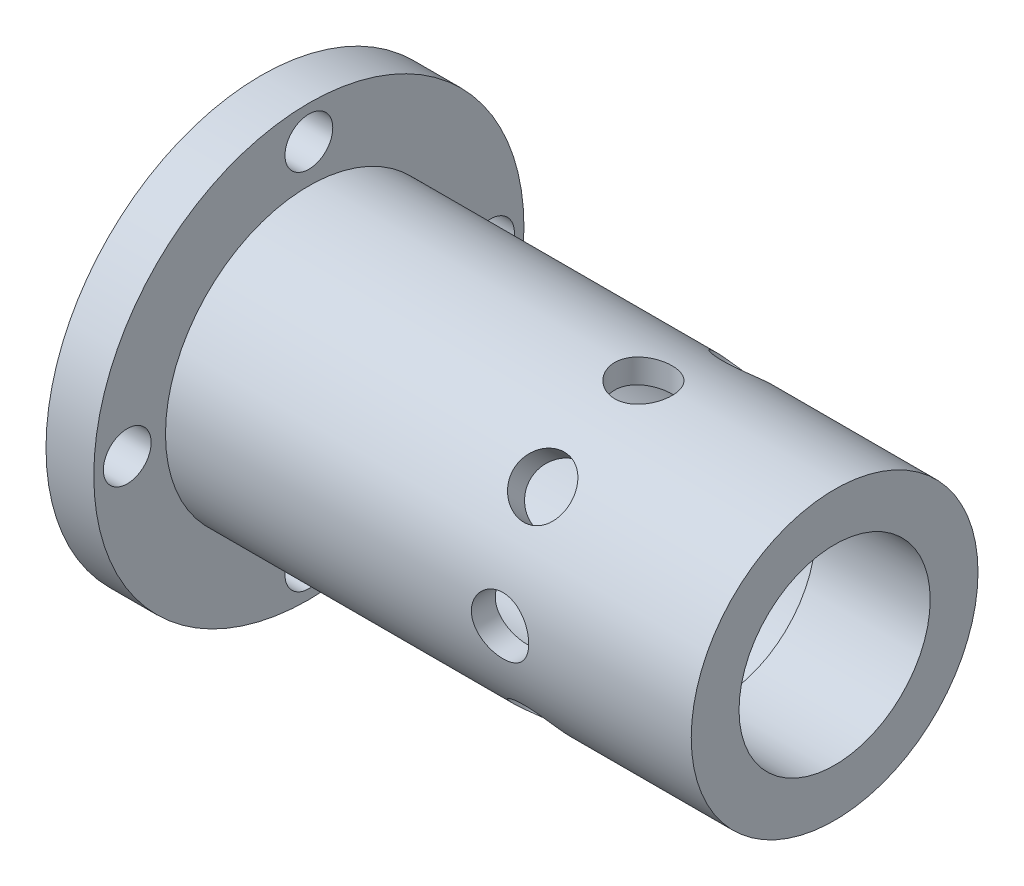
ISO-10303-21;
HEADER;
FILE_DESCRIPTION(('STEP AP214'),'2;1');
FILE_NAME('part.step','',(''),(''),'','','');
FILE_SCHEMA(('AUTOMOTIVE_DESIGN { 1 0 10303 214 1 1 1 1 }'));
ENDSEC;
DATA;
#1=APPLICATION_CONTEXT('core data for automotive mechanical design processes');
#2=APPLICATION_PROTOCOL_DEFINITION('international standard','automotive_design',2000,#1);
#3=PRODUCT_CONTEXT('',#1,'mechanical');
#4=PRODUCT('Part','Part','',(#3));
#5=PRODUCT_RELATED_PRODUCT_CATEGORY('part','',(#4));
#6=PRODUCT_DEFINITION_FORMATION('','',#4);
#7=PRODUCT_DEFINITION_CONTEXT('part definition',#1,'design');
#8=PRODUCT_DEFINITION('design','',#6,#7);
#9=PRODUCT_DEFINITION_SHAPE('','',#8);
#10=(LENGTH_UNIT() NAMED_UNIT(*) SI_UNIT(.MILLI.,.METRE.));
#11=(NAMED_UNIT(*) PLANE_ANGLE_UNIT() SI_UNIT($,.RADIAN.));
#12=(NAMED_UNIT(*) SI_UNIT($,.STERADIAN.) SOLID_ANGLE_UNIT());
#13=UNCERTAINTY_MEASURE_WITH_UNIT(LENGTH_MEASURE(1.E-05),#10,'distance_accuracy_value','');
#14=(GEOMETRIC_REPRESENTATION_CONTEXT(3) GLOBAL_UNCERTAINTY_ASSIGNED_CONTEXT((#13)) GLOBAL_UNIT_ASSIGNED_CONTEXT((#10,
#11,#12)) REPRESENTATION_CONTEXT('',''));
#15=CARTESIAN_POINT('',(0.,0.,0.));
#16=DIRECTION('',(0.,0.,1.));
#17=DIRECTION('',(1.,0.,0.));
#18=AXIS2_PLACEMENT_3D('',#15,#16,#17);
#19=CARTESIAN_POINT('',(0.,0.,0.));
#20=DIRECTION('',(1.,0.,0.));
#21=DIRECTION('',(0.,0.,-1.));
#22=AXIS2_PLACEMENT_3D('',#19,#20,#21);
#23=PLANE('',#22);
#24=CARTESIAN_POINT('',(0.,1.99014551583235E-13,-19.));
#25=DIRECTION('',(1.,0.,0.));
#26=DIRECTION('',(0.,0.,-1.));
#27=AXIS2_PLACEMENT_3D('',#24,#25,#26);
#28=CIRCLE('',#27,2.5);
#29=CARTESIAN_POINT('',(0.,1.99014551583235E-13,-21.5));
#30=VERTEX_POINT('',#29);
#31=EDGE_CURVE('E244',#30,#30,#28,.T.);
#32=ORIENTED_EDGE('',*,*,#31,.T.);
#33=EDGE_LOOP('',(#32));
#34=FACE_BOUND('',#33,.T.);
#35=CARTESIAN_POINT('',(0.,-19.,0.));
#36=DIRECTION('',(1.,0.,0.));
#37=DIRECTION('',(0.,0.,-1.));
#38=AXIS2_PLACEMENT_3D('',#35,#36,#37);
#39=CIRCLE('',#38,2.5);
#40=CARTESIAN_POINT('',(0.,-19.,-2.5));
#41=VERTEX_POINT('',#40);
#42=EDGE_CURVE('E238',#41,#41,#39,.T.);
#43=ORIENTED_EDGE('',*,*,#42,.T.);
#44=EDGE_LOOP('',(#43));
#45=FACE_BOUND('',#44,.T.);
#46=CARTESIAN_POINT('',(0.,0.,19.));
#47=DIRECTION('',(1.,0.,0.));
#48=DIRECTION('',(0.,0.,-1.));
#49=AXIS2_PLACEMENT_3D('',#46,#47,#48);
#50=CIRCLE('',#49,2.5);
#51=CARTESIAN_POINT('',(0.,0.,16.5));
#52=VERTEX_POINT('',#51);
#53=EDGE_CURVE('E230',#52,#52,#50,.T.);
#54=ORIENTED_EDGE('',*,*,#53,.T.);
#55=EDGE_LOOP('',(#54));
#56=FACE_BOUND('',#55,.T.);
#57=CARTESIAN_POINT('',(0.,19.,0.));
#58=DIRECTION('',(1.,0.,0.));
#59=DIRECTION('',(0.,0.,-1.));
#60=AXIS2_PLACEMENT_3D('',#57,#58,#59);
#61=CIRCLE('',#60,2.5);
#62=CARTESIAN_POINT('',(0.,19.,-2.5));
#63=VERTEX_POINT('',#62);
#64=EDGE_CURVE('E223',#63,#63,#61,.T.);
#65=ORIENTED_EDGE('',*,*,#64,.T.);
#66=EDGE_LOOP('',(#65));
#67=FACE_BOUND('',#66,.T.);
#68=CARTESIAN_POINT('',(0.,0.,0.));
#69=DIRECTION('',(-1.,0.,0.));
#70=DIRECTION('',(0.,0.,1.));
#71=AXIS2_PLACEMENT_3D('',#68,#69,#70);
#72=CIRCLE('',#71,12.5);
#73=CARTESIAN_POINT('',(0.,0.,12.5));
#74=VERTEX_POINT('',#73);
#75=EDGE_CURVE('E55',#74,#74,#72,.T.);
#76=ORIENTED_EDGE('',*,*,#75,.F.);
#77=EDGE_LOOP('',(#76));
#78=FACE_BOUND('',#77,.T.);
#79=CARTESIAN_POINT('',(0.,0.,0.));
#80=DIRECTION('',(-1.,0.,0.));
#81=DIRECTION('',(0.,0.,1.));
#82=AXIS2_PLACEMENT_3D('',#79,#80,#81);
#83=CIRCLE('',#82,22.5);
#84=CARTESIAN_POINT('',(0.,0.,22.5));
#85=VERTEX_POINT('',#84);
#86=EDGE_CURVE('E10',#85,#85,#83,.T.);
#87=ORIENTED_EDGE('',*,*,#86,.T.);
#88=EDGE_LOOP('',(#87));
#89=FACE_BOUND('',#88,.T.);
#90=ADVANCED_FACE('F29',(#34,#45,#56,#67,#78,#89),#23,.F.);
#91=CARTESIAN_POINT('',(-15.8054964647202,0.,0.));
#92=DIRECTION('',(-1.,0.,0.));
#93=DIRECTION('',(0.,0.,1.));
#94=AXIS2_PLACEMENT_3D('',#91,#92,#93);
#95=CYLINDRICAL_SURFACE('',#94,22.5);
#96=ORIENTED_EDGE('',*,*,#86,.F.);
#97=EDGE_LOOP('',(#96));
#98=FACE_BOUND('',#97,.T.);
#99=CARTESIAN_POINT('',(5.,0.,0.));
#100=DIRECTION('',(-1.,0.,0.));
#101=DIRECTION('',(0.,0.,1.));
#102=AXIS2_PLACEMENT_3D('',#99,#100,#101);
#103=CIRCLE('',#102,22.5);
#104=CARTESIAN_POINT('',(5.,0.,22.5));
#105=VERTEX_POINT('',#104);
#106=EDGE_CURVE('E35',#105,#105,#103,.T.);
#107=ORIENTED_EDGE('',*,*,#106,.T.);
#108=EDGE_LOOP('',(#107));
#109=FACE_BOUND('',#108,.T.);
#110=ADVANCED_FACE('F258',(#98,#109),#95,.T.);
#111=CARTESIAN_POINT('',(5.,22.5,0.));
#112=DIRECTION('',(-1.,0.,0.));
#113=DIRECTION('',(0.,0.,1.));
#114=AXIS2_PLACEMENT_3D('',#111,#112,#113);
#115=PLANE('',#114);
#116=CARTESIAN_POINT('',(5.,1.99014551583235E-13,-19.));
#117=DIRECTION('',(1.,0.,0.));
#118=DIRECTION('',(0.,-1.,0.));
#119=AXIS2_PLACEMENT_3D('',#116,#117,#118);
#120=CIRCLE('',#119,2.5);
#121=CARTESIAN_POINT('',(5.,-2.4999999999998,-19.));
#122=VERTEX_POINT('',#121);
#123=EDGE_CURVE('E247',#122,#122,#120,.T.);
#124=ORIENTED_EDGE('',*,*,#123,.F.);
#125=EDGE_LOOP('',(#124));
#126=FACE_BOUND('',#125,.T.);
#127=CARTESIAN_POINT('',(5.,-19.,0.));
#128=DIRECTION('',(1.,0.,0.));
#129=DIRECTION('',(0.,0.,1.));
#130=AXIS2_PLACEMENT_3D('',#127,#128,#129);
#131=CIRCLE('',#130,2.5);
#132=CARTESIAN_POINT('',(5.,-19.,2.5));
#133=VERTEX_POINT('',#132);
#134=EDGE_CURVE('E241',#133,#133,#131,.T.);
#135=ORIENTED_EDGE('',*,*,#134,.F.);
#136=EDGE_LOOP('',(#135));
#137=FACE_BOUND('',#136,.T.);
#138=CARTESIAN_POINT('',(5.,0.,19.));
#139=DIRECTION('',(1.,0.,0.));
#140=DIRECTION('',(0.,1.,0.));
#141=AXIS2_PLACEMENT_3D('',#138,#139,#140);
#142=CIRCLE('',#141,2.5);
#143=CARTESIAN_POINT('',(5.,2.49999999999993,19.));
#144=VERTEX_POINT('',#143);
#145=EDGE_CURVE('E235',#144,#144,#142,.T.);
#146=ORIENTED_EDGE('',*,*,#145,.F.);
#147=EDGE_LOOP('',(#146));
#148=FACE_BOUND('',#147,.T.);
#149=CARTESIAN_POINT('',(5.,19.,0.));
#150=DIRECTION('',(1.,0.,0.));
#151=DIRECTION('',(0.,0.,-1.));
#152=AXIS2_PLACEMENT_3D('',#149,#150,#151);
#153=CIRCLE('',#152,2.5);
#154=CARTESIAN_POINT('',(5.,19.,-2.5));
#155=VERTEX_POINT('',#154);
#156=EDGE_CURVE('E226',#155,#155,#153,.T.);
#157=ORIENTED_EDGE('',*,*,#156,.F.);
#158=EDGE_LOOP('',(#157));
#159=FACE_BOUND('',#158,.T.);
#160=ORIENTED_EDGE('',*,*,#106,.F.);
#161=EDGE_LOOP('',(#160));
#162=FACE_BOUND('',#161,.T.);
#163=CARTESIAN_POINT('',(5.,0.,0.));
#164=DIRECTION('',(-1.,0.,0.));
#165=DIRECTION('',(0.,0.,1.));
#166=AXIS2_PLACEMENT_3D('',#163,#164,#165);
#167=CIRCLE('',#166,15.);
#168=CARTESIAN_POINT('',(5.,0.,15.));
#169=VERTEX_POINT('',#168);
#170=EDGE_CURVE('E39',#169,#169,#167,.T.);
#171=ORIENTED_EDGE('',*,*,#170,.T.);
#172=EDGE_LOOP('',(#171));
#173=FACE_BOUND('',#172,.T.);
#174=ADVANCED_FACE('F254',(#126,#137,#148,#159,#162,#173),#115,.F.);
#175=CARTESIAN_POINT('',(-15.8054964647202,0.,0.));
#176=DIRECTION('',(-1.,0.,0.));
#177=DIRECTION('',(0.,0.,1.));
#178=AXIS2_PLACEMENT_3D('',#175,#176,#177);
#179=CYLINDRICAL_SURFACE('',#178,15.);
#180=CARTESIAN_POINT('',(40.,-12.5136251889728,-8.27098450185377));
#181=CARTESIAN_POINT('',(39.8333068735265,-12.513623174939,-8.27099120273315));
#182=CARTESIAN_POINT('',(39.66653613,-12.5057949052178,-8.2828690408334));
#183=CARTESIAN_POINT('',(39.3377124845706,-12.4745443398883,-8.32985653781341));
#184=CARTESIAN_POINT('',(39.1756634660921,-12.4511095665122,-8.36498478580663));
#185=CARTESIAN_POINT('',(38.8610880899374,-12.388902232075,-8.45684073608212));
#186=CARTESIAN_POINT('',(38.7085524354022,-12.3501449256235,-8.51354695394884));
#187=CARTESIAN_POINT('',(38.4169754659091,-12.2576828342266,-8.64613873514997));
#188=CARTESIAN_POINT('',(38.2779333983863,-12.2039788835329,-8.72202322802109));
#189=CARTESIAN_POINT('',(38.0153169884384,-12.081411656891,-8.89103463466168));
#190=CARTESIAN_POINT('',(37.8919612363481,-12.0123647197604,-8.98436806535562));
#191=CARTESIAN_POINT('',(37.6661273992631,-11.8603688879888,-9.18408233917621));
#192=CARTESIAN_POINT('',(37.5636507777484,-11.7774190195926,-9.29046409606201));
#193=CARTESIAN_POINT('',(37.3816359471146,-11.5980841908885,-9.51341451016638));
#194=CARTESIAN_POINT('',(37.3023054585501,-11.5015884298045,-9.63006387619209));
#195=CARTESIAN_POINT('',(37.1701751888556,-11.2975614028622,-9.86862241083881));
#196=CARTESIAN_POINT('',(37.117372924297,-11.1900311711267,-9.99053108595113));
#197=CARTESIAN_POINT('',(37.0404784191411,-10.9679049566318,-10.2338569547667));
#198=CARTESIAN_POINT('',(37.016017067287,-10.8534207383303,-10.3552594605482));
#199=CARTESIAN_POINT('',(36.9953471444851,-10.6191764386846,-10.5953388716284));
#200=CARTESIAN_POINT('',(36.9991358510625,-10.4994168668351,-10.7140160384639));
#201=CARTESIAN_POINT('',(37.0345785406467,-10.2598981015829,-10.9435657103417));
#202=CARTESIAN_POINT('',(37.0658349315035,-10.1401631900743,-11.0545252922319));
#203=CARTESIAN_POINT('',(37.1546950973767,-9.90272672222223,-11.2677184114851));
#204=CARTESIAN_POINT('',(37.2122999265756,-9.78502524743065,-11.3699515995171));
#205=CARTESIAN_POINT('',(37.3525901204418,-9.5547524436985,-11.5641496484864));
#206=CARTESIAN_POINT('',(37.4354312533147,-9.44221811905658,-11.656045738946));
#207=CARTESIAN_POINT('',(37.6237272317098,-9.22689422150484,-11.8272301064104));
#208=CARTESIAN_POINT('',(37.7291846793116,-9.12410577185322,-11.9065169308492));
#209=CARTESIAN_POINT('',(37.9619008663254,-8.93024573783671,-12.052623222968));
#210=CARTESIAN_POINT('',(38.0895075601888,-8.83940960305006,-12.1192012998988));
#211=CARTESIAN_POINT('',(38.3617493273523,-8.67513365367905,-12.237333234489));
#212=CARTESIAN_POINT('',(38.5063847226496,-8.60169416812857,-12.2888868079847));
#213=CARTESIAN_POINT('',(38.8090624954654,-8.47513649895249,-12.3765111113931));
#214=CARTESIAN_POINT('',(38.967132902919,-8.42206214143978,-12.4125484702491));
#215=CARTESIAN_POINT('',(39.291913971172,-8.33885601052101,-12.4686014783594));
#216=CARTESIAN_POINT('',(39.4586235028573,-8.30872124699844,-12.4886192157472));
#217=CARTESIAN_POINT('',(39.7928945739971,-8.27312555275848,-12.5122279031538));
#218=CARTESIAN_POINT('',(39.960392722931,-8.26725124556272,-12.5160940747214));
#219=CARTESIAN_POINT('',(40.2941446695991,-8.27931650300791,-12.5081161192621));
#220=CARTESIAN_POINT('',(40.4603985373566,-8.29725471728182,-12.4962728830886));
#221=CARTESIAN_POINT('',(40.7853059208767,-8.35581744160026,-12.457187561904));
#222=CARTESIAN_POINT('',(40.9440170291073,-8.39622276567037,-12.4300942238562));
#223=CARTESIAN_POINT('',(41.2511898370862,-8.49778413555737,-12.3608825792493));
#224=CARTESIAN_POINT('',(41.3996506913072,-8.55894189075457,-12.3187630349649));
#225=CARTESIAN_POINT('',(41.6842393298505,-8.70040429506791,-12.2192680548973));
#226=CARTESIAN_POINT('',(41.8201811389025,-8.78094812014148,-12.1617009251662));
#227=CARTESIAN_POINT('',(42.0739249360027,-8.95757566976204,-12.0321985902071));
#228=CARTESIAN_POINT('',(42.1917250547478,-9.05366099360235,-11.9602619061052));
#229=CARTESIAN_POINT('',(42.4076876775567,-9.25939610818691,-11.8017233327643));
#230=CARTESIAN_POINT('',(42.50552096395,-9.36923148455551,-11.7149132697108));
#231=CARTESIAN_POINT('',(42.6764376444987,-9.59728466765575,-11.5288227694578));
#232=CARTESIAN_POINT('',(42.7495220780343,-9.71550212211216,-11.4295428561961));
#233=CARTESIAN_POINT('',(42.8683866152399,-9.95550541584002,-11.221096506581));
#234=CARTESIAN_POINT('',(42.9143215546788,-10.0772667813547,-11.1119903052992));
#235=CARTESIAN_POINT('',(42.9780737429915,-10.3209508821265,-10.886025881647));
#236=CARTESIAN_POINT('',(42.995894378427,-10.4428735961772,-10.7691685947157));
#237=CARTESIAN_POINT('',(43.0027809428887,-10.6809715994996,-10.5330184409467));
#238=CARTESIAN_POINT('',(42.9923418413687,-10.7972099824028,-10.4138033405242));
#239=CARTESIAN_POINT('',(42.9440981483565,-11.0229563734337,-10.174551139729));
#240=CARTESIAN_POINT('',(42.9062939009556,-11.1324644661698,-10.0545140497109));
#241=CARTESIAN_POINT('',(42.8046130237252,-11.3418677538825,-9.81768742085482));
#242=CARTESIAN_POINT('',(42.7407958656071,-11.4417842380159,-9.70089111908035));
#243=CARTESIAN_POINT('',(42.5889632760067,-11.6302839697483,-9.47408394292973));
#244=CARTESIAN_POINT('',(42.5009459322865,-11.7188663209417,-9.36407360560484));
#245=CARTESIAN_POINT('',(42.3015418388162,-11.8845696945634,-9.15288655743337));
#246=CARTESIAN_POINT('',(42.1898009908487,-11.961482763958,-9.05188098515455));
#247=CARTESIAN_POINT('',(41.9468492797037,-12.1010609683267,-8.86442413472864));
#248=CARTESIAN_POINT('',(41.8156338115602,-12.1637227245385,-8.77797630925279));
#249=CARTESIAN_POINT('',(41.5357620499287,-12.2746503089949,-8.62219395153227));
#250=CARTESIAN_POINT('',(41.3869331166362,-12.3227538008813,-8.55305378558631));
#251=CARTESIAN_POINT('',(41.0772016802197,-12.4030978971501,-8.43612682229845));
#252=CARTESIAN_POINT('',(40.9163102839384,-12.4353528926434,-8.38832065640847));
#253=CARTESIAN_POINT('',(40.6292126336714,-12.4775340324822,-8.32539252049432));
#254=CARTESIAN_POINT('',(40.5046437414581,-12.4910591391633,-8.30504116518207));
#255=CARTESIAN_POINT('',(40.2533981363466,-12.5091053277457,-8.27783484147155));
#256=CARTESIAN_POINT('',(40.1267214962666,-12.513626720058,-8.27097940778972));
#257=CARTESIAN_POINT('',(40.,-12.5136251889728,-8.27098450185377));
#258=B_SPLINE_CURVE_WITH_KNOTS('',3,(#180,#181,#182,#183,#184,#185,#186,#187,#188,#189,#190,
#191,#192,#193,#194,#195,#196,#197,#198,#199,#200,#201,#202,#203,#204,#205,#206,#207,#208,#209,
#210,#211,#212,#213,#214,#215,#216,#217,#218,#219,#220,#221,#222,#223,#224,#225,#226,#227,#228,
#229,#230,#231,#232,#233,#234,#235,#236,#237,#238,#239,#240,#241,#242,#243,#244,#245,#246,#247,
#248,#249,#250,#251,#252,#253,#254,#255,#256,#257),.UNSPECIFIED.,.T.,.F.,(4,2,2,2,2,2,2,2,2,2,2,
2,2,2,2,2,2,2,2,2,2,2,2,2,2,2,2,2,2,2,2,2,2,2,2,2,2,2,4),(0.,0.499615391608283,0.99963071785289,
1.49914949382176,1.99864039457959,2.5044675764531,3.01033020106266,3.52060201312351,
4.03082604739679,4.53432746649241,5.03778036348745,5.53406368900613,6.03036687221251,
6.5297977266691,7.02928607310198,7.5374804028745,8.04568434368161,8.5549758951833,
9.06420105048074,9.56471273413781,10.0651960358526,10.5608802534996,11.056605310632,
11.5587917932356,12.0610299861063,12.5709780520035,13.0809046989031,13.5878944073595,
14.0948230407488,14.5929305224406,15.0910317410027,15.5880005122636,16.0850085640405,
16.5900345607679,17.0951801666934,17.6057669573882,18.1158892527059,18.4957141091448,
18.8755258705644),.UNSPECIFIED.);
#259=CARTESIAN_POINT('',(40.,-12.5136251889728,-8.27098450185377));
#260=VERTEX_POINT('',#259);
#261=EDGE_CURVE('E189',#260,#260,#258,.T.);
#262=ORIENTED_EDGE('',*,*,#261,.F.);
#263=EDGE_LOOP('',(#262));
#264=FACE_BOUND('',#263,.T.);
#265=CARTESIAN_POINT('',(40.,-14.6969384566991,2.99999999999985));
#266=CARTESIAN_POINT('',(39.8333068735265,-14.6969417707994,2.99999383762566));
#267=CARTESIAN_POINT('',(39.66653613,-14.6998052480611,2.98605951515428));
#268=CARTESIAN_POINT('',(39.3377124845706,-14.7109329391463,2.93073685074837));
#269=CARTESIAN_POINT('',(39.1756634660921,-14.7192014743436,2.88932654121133));
#270=CARTESIAN_POINT('',(38.8610880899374,-14.7401662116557,2.78038734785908));
#271=CARTESIAN_POINT('',(38.7085524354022,-14.7528580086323,2.71288444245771));
#272=CARTESIAN_POINT('',(38.4169754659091,-14.7812339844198,2.55374732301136));
#273=CARTESIAN_POINT('',(38.2779333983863,-14.7969179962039,2.4621144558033));
#274=CARTESIAN_POINT('',(38.0153169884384,-14.8297589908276,2.25593722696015));
#275=CARTESIAN_POINT('',(37.8919612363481,-14.8469321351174,2.1411169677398));
#276=CARTESIAN_POINT('',(37.6661273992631,-14.880674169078,1.89242036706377));
#277=CARTESIAN_POINT('',(37.5636507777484,-14.897243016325,1.7585426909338));
#278=CARTESIAN_POINT('',(37.3816359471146,-14.9280838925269,1.47408406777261));
#279=CARTESIAN_POINT('',(37.3023054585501,-14.9423346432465,1.32336770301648));
#280=CARTESIAN_POINT('',(37.1701751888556,-14.9667521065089,1.01041245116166));
#281=CARTESIAN_POINT('',(37.117372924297,-14.9769192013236,0.848174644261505));
#282=CARTESIAN_POINT('',(37.0404784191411,-14.9919096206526,0.519050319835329));
#283=CARTESIAN_POINT('',(37.016017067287,-14.9968015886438,0.352253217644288));
#284=CARTESIAN_POINT('',(36.9953471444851,-15.0009276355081,0.0168557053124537));
#285=CARTESIAN_POINT('',(36.9991358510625,-15.0001622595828,-0.151744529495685));
#286=CARTESIAN_POINT('',(37.0345785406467,-14.9931130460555,-0.483426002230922));
#287=CARTESIAN_POINT('',(37.0658349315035,-14.9869079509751,-0.646551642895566));
#288=CARTESIAN_POINT('',(37.1546950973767,-14.9697653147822,-0.96519487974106));
#289=CARTESIAN_POINT('',(37.2122999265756,-14.9588275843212,-1.12071217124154));
#290=CARTESIAN_POINT('',(37.3525901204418,-14.9333188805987,-1.42085838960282));
#291=CARTESIAN_POINT('',(37.4354312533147,-14.9187254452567,-1.56541252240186));
#292=CARTESIAN_POINT('',(37.6237272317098,-14.8875140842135,-1.83871513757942));
#293=CARTESIAN_POINT('',(37.7291846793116,-14.8708959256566,-1.96746179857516));
#294=CARTESIAN_POINT('',(37.9619008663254,-14.8371289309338,-2.20785429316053));
#295=CARTESIAN_POINT('',(38.0895075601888,-14.8199758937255,-2.31916294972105));
#296=CARTESIAN_POINT('',(38.3617493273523,-14.7873471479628,-2.51885547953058));
#297=CARTESIAN_POINT('',(38.5063847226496,-14.7718714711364,-2.60723891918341));
#298=CARTESIAN_POINT('',(38.8090624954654,-14.7443414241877,-2.7586884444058));
#299=CARTESIAN_POINT('',(38.967132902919,-14.7322944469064,-2.82169994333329));
#300=CARTESIAN_POINT('',(39.291913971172,-14.7130942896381,-2.9201710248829));
#301=CARTESIAN_POINT('',(39.4586235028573,-14.7059404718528,-2.95563419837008));
#302=CARTESIAN_POINT('',(39.7928945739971,-14.6974643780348,-2.99749801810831));
#303=CARTESIAN_POINT('',(39.960392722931,-14.6960444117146,-3.00438557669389));
#304=CARTESIAN_POINT('',(40.2941446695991,-14.6989345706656,-2.99021288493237));
#305=CARTESIAN_POINT('',(40.4603985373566,-14.7032443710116,-2.96915421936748));
#306=CARTESIAN_POINT('',(40.7853059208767,-14.7170169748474,-2.90010662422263));
#307=CARTESIAN_POINT('',(40.9440170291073,-14.7264299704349,-2.85237786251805));
#308=CARTESIAN_POINT('',(41.2511898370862,-14.7493046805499,-2.73162310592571));
#309=CARTESIAN_POINT('',(41.3996506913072,-14.7627667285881,-2.65859502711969));
#310=CARTESIAN_POINT('',(41.6842393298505,-14.7924421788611,-2.48821242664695));
#311=CARTESIAN_POINT('',(41.8201811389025,-14.8086891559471,-2.39055323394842));
#312=CARTESIAN_POINT('',(42.0739249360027,-14.8420117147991,-2.17408671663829));
#313=CARTESIAN_POINT('',(42.1917250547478,-14.8590873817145,-2.05527721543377));
#314=CARTESIAN_POINT('',(42.4076876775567,-14.8924603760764,-1.79769682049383));
#315=CARTESIAN_POINT('',(42.50552096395,-14.9087417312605,-1.65864749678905));
#316=CARTESIAN_POINT('',(42.6764376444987,-14.9384138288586,-1.36580368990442));
#317=CARTESIAN_POINT('',(42.7495220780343,-14.9518046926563,-1.21200982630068));
#318=CARTESIAN_POINT('',(42.8683866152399,-14.974118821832,-0.894908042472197));
#319=CARTESIAN_POINT('',(42.9143215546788,-14.9830673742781,-0.731660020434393));
#320=CARTESIAN_POINT('',(42.9780737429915,-14.9955970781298,-0.399568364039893));
#321=CARTESIAN_POINT('',(42.995894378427,-14.9991788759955,-0.230725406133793));
#322=CARTESIAN_POINT('',(43.0027809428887,-15.0005562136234,0.104618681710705));
#323=CARTESIAN_POINT('',(42.9923418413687,-14.9984513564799,0.271109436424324));
#324=CARTESIAN_POINT('',(42.9440981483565,-14.9889013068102,0.599913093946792));
#325=CARTESIAN_POINT('',(42.9062939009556,-14.9814561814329,0.76222604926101));
#326=CARTESIAN_POINT('',(42.8046130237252,-14.9620649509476,1.07775824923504));
#327=CARTESIAN_POINT('',(42.7407958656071,-14.9501291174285,1.23099732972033));
#328=CARTESIAN_POINT('',(42.5889632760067,-14.9230416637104,1.52466366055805));
#329=CARTESIAN_POINT('',(42.5009459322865,-14.9078897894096,1.66508989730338));
#330=CARTESIAN_POINT('',(42.3015418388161,-14.8757279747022,1.93159167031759));
#331=CARTESIAN_POINT('',(42.1898009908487,-14.858692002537,2.05739914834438));
#332=CARTESIAN_POINT('',(41.9468492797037,-14.824836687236,2.28864785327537));
#333=CARTESIAN_POINT('',(41.8156338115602,-14.8080173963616,2.39408424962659));
#334=CARTESIAN_POINT('',(41.5357620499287,-14.776300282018,2.58267665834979));
#335=CARTESIAN_POINT('',(41.3869331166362,-14.7614251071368,2.66558044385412));
#336=CARTESIAN_POINT('',(41.0772016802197,-14.7355571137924,2.80507214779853));
#337=CARTESIAN_POINT('',(40.9163102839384,-14.7245607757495,2.86168393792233));
#338=CARTESIAN_POINT('',(40.6292126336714,-14.7098904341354,2.93600741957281));
#339=CARTESIAN_POINT('',(40.5046437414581,-14.7050635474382,2.9599616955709));
#340=CARTESIAN_POINT('',(40.2533981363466,-14.6985863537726,2.99196005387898));
#341=CARTESIAN_POINT('',(40.1267214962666,-14.6969359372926,3.00000468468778));
#342=CARTESIAN_POINT('',(40.,-14.6969384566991,2.99999999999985));
#343=B_SPLINE_CURVE_WITH_KNOTS('',3,(#265,#266,#267,#268,#269,#270,#271,#272,#273,#274,#275,
#276,#277,#278,#279,#280,#281,#282,#283,#284,#285,#286,#287,#288,#289,#290,#291,#292,#293,#294,
#295,#296,#297,#298,#299,#300,#301,#302,#303,#304,#305,#306,#307,#308,#309,#310,#311,#312,#313,
#314,#315,#316,#317,#318,#319,#320,#321,#322,#323,#324,#325,#326,#327,#328,#329,#330,#331,#332,
#333,#334,#335,#336,#337,#338,#339,#340,#341,#342),.UNSPECIFIED.,.T.,.F.,(4,2,2,2,2,2,2,2,2,2,2,
2,2,2,2,2,2,2,2,2,2,2,2,2,2,2,2,2,2,2,2,2,2,2,2,2,2,2,4),(0.,0.499615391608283,
0.999630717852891,1.49914949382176,1.99864039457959,2.50446757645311,3.01033020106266,
3.52060201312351,4.03082604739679,4.53432746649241,5.03778036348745,5.53406368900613,
6.03036687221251,6.5297977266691,7.02928607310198,7.5374804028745,8.04568434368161,
8.55497589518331,9.06420105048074,9.56471273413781,10.0651960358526,10.5608802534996,
11.056605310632,11.5587917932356,12.0610299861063,12.5709780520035,13.0809046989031,
13.5878944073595,14.0948230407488,14.5929305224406,15.0910317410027,15.5880005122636,
16.0850085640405,16.5900345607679,17.0951801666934,17.6057669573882,18.1158892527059,
18.4957141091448,18.8755258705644),.UNSPECIFIED.);
#344=CARTESIAN_POINT('',(40.,-14.6969384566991,2.99999999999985));
#345=VERTEX_POINT('',#344);
#346=EDGE_CURVE('E182',#345,#345,#343,.T.);
#347=ORIENTED_EDGE('',*,*,#346,.F.);
#348=EDGE_LOOP('',(#347));
#349=FACE_BOUND('',#348,.T.);
#350=CARTESIAN_POINT('',(40.,-8.27098450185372,12.5136251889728));
#351=CARTESIAN_POINT('',(39.8333068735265,-8.27099120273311,12.5136231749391));
#352=CARTESIAN_POINT('',(39.66653613,-8.28286904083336,12.5057949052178));
#353=CARTESIAN_POINT('',(39.3377124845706,-8.32985653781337,12.4745443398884));
#354=CARTESIAN_POINT('',(39.1756634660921,-8.36498478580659,12.4511095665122));
#355=CARTESIAN_POINT('',(38.8610880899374,-8.45684073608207,12.388902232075));
#356=CARTESIAN_POINT('',(38.7085524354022,-8.5135469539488,12.3501449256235));
#357=CARTESIAN_POINT('',(38.4169754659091,-8.64613873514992,12.2576828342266));
#358=CARTESIAN_POINT('',(38.2779333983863,-8.72202322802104,12.203978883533));
#359=CARTESIAN_POINT('',(38.0153169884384,-8.89103463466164,12.0814116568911));
#360=CARTESIAN_POINT('',(37.8919612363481,-8.98436806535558,12.0123647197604));
#361=CARTESIAN_POINT('',(37.6661273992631,-9.18408233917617,11.8603688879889));
#362=CARTESIAN_POINT('',(37.5636507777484,-9.29046409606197,11.7774190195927));
#363=CARTESIAN_POINT('',(37.3816359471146,-9.51341451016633,11.5980841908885));
#364=CARTESIAN_POINT('',(37.3023054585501,-9.63006387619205,11.5015884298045));
#365=CARTESIAN_POINT('',(37.1701751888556,-9.86862241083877,11.2975614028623));
#366=CARTESIAN_POINT('',(37.117372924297,-9.9905310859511,11.1900311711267));
#367=CARTESIAN_POINT('',(37.0404784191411,-10.2338569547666,10.9679049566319));
#368=CARTESIAN_POINT('',(37.016017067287,-10.3552594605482,10.8534207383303));
#369=CARTESIAN_POINT('',(36.9953471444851,-10.5953388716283,10.6191764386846));
#370=CARTESIAN_POINT('',(36.9991358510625,-10.7140160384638,10.4994168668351));
#371=CARTESIAN_POINT('',(37.0345785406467,-10.9435657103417,10.2598981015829));
#372=CARTESIAN_POINT('',(37.0658349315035,-11.0545252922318,10.1401631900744));
#373=CARTESIAN_POINT('',(37.1546950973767,-11.2677184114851,9.90272672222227));
#374=CARTESIAN_POINT('',(37.2122999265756,-11.369951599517,9.78502524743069));
#375=CARTESIAN_POINT('',(37.3525901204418,-11.5641496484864,9.55475244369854));
#376=CARTESIAN_POINT('',(37.4354312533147,-11.656045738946,9.44221811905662));
#377=CARTESIAN_POINT('',(37.6237272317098,-11.8272301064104,9.22689422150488));
#378=CARTESIAN_POINT('',(37.7291846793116,-11.9065169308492,9.12410577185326));
#379=CARTESIAN_POINT('',(37.9619008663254,-12.052623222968,8.93024573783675));
#380=CARTESIAN_POINT('',(38.0895075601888,-12.1192012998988,8.8394096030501));
#381=CARTESIAN_POINT('',(38.3617493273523,-12.237333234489,8.6751336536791));
#382=CARTESIAN_POINT('',(38.5063847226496,-12.2888868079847,8.60169416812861));
#383=CARTESIAN_POINT('',(38.8090624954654,-12.3765111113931,8.47513649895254));
#384=CARTESIAN_POINT('',(38.967132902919,-12.4125484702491,8.42206214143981));
#385=CARTESIAN_POINT('',(39.291913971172,-12.4686014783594,8.33885601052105));
#386=CARTESIAN_POINT('',(39.4586235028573,-12.4886192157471,8.30872124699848));
#387=CARTESIAN_POINT('',(39.7928945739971,-12.5122279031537,8.27312555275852));
#388=CARTESIAN_POINT('',(39.960392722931,-12.5160940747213,8.26725124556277));
#389=CARTESIAN_POINT('',(40.2941446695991,-12.5081161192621,8.27931650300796));
#390=CARTESIAN_POINT('',(40.4603985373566,-12.4962728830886,8.29725471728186));
#391=CARTESIAN_POINT('',(40.7853059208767,-12.457187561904,8.3558174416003));
#392=CARTESIAN_POINT('',(40.9440170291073,-12.4300942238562,8.39622276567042));
#393=CARTESIAN_POINT('',(41.2511898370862,-12.3608825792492,8.49778413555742));
#394=CARTESIAN_POINT('',(41.3996506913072,-12.3187630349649,8.55894189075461));
#395=CARTESIAN_POINT('',(41.6842393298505,-12.2192680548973,8.70040429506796));
#396=CARTESIAN_POINT('',(41.8201811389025,-12.1617009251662,8.78094812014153));
#397=CARTESIAN_POINT('',(42.0739249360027,-12.0321985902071,8.95757566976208));
#398=CARTESIAN_POINT('',(42.1917250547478,-11.9602619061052,9.05366099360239));
#399=CARTESIAN_POINT('',(42.4076876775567,-11.8017233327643,9.25939610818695));
#400=CARTESIAN_POINT('',(42.50552096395,-11.7149132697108,9.36923148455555));
#401=CARTESIAN_POINT('',(42.6764376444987,-11.5288227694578,9.59728466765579));
#402=CARTESIAN_POINT('',(42.7495220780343,-11.429542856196,9.71550212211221));
#403=CARTESIAN_POINT('',(42.8683866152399,-11.221096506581,9.95550541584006));
#404=CARTESIAN_POINT('',(42.9143215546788,-11.1119903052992,10.0772667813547));
#405=CARTESIAN_POINT('',(42.9780737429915,-10.886025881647,10.3209508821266));
#406=CARTESIAN_POINT('',(42.995894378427,-10.7691685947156,10.4428735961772));
#407=CARTESIAN_POINT('',(43.0027809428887,-10.5330184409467,10.6809715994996));
#408=CARTESIAN_POINT('',(42.9923418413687,-10.4138033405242,10.7972099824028));
#409=CARTESIAN_POINT('',(42.9440981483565,-10.174551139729,11.0229563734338));
#410=CARTESIAN_POINT('',(42.9062939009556,-10.0545140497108,11.1324644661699));
#411=CARTESIAN_POINT('',(42.8046130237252,-9.81768742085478,11.3418677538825));
#412=CARTESIAN_POINT('',(42.7407958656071,-9.70089111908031,11.4417842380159));
#413=CARTESIAN_POINT('',(42.5889632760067,-9.47408394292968,11.6302839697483));
#414=CARTESIAN_POINT('',(42.5009459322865,-9.3640736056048,11.7188663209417));
#415=CARTESIAN_POINT('',(42.3015418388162,-9.15288655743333,11.8845696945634));
#416=CARTESIAN_POINT('',(42.1898009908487,-9.0518809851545,11.961482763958));
#417=CARTESIAN_POINT('',(41.9468492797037,-8.8644241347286,12.1010609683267));
#418=CARTESIAN_POINT('',(41.8156338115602,-8.77797630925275,12.1637227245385));
#419=CARTESIAN_POINT('',(41.5357620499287,-8.62219395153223,12.274650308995));
#420=CARTESIAN_POINT('',(41.3869331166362,-8.55305378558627,12.3227538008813));
#421=CARTESIAN_POINT('',(41.0772016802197,-8.43612682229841,12.4030978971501));
#422=CARTESIAN_POINT('',(40.9163102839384,-8.38832065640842,12.4353528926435));
#423=CARTESIAN_POINT('',(40.6292126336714,-8.32539252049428,12.4775340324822));
#424=CARTESIAN_POINT('',(40.5046437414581,-8.30504116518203,12.4910591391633));
#425=CARTESIAN_POINT('',(40.2533981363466,-8.2778348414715,12.5091053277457));
#426=CARTESIAN_POINT('',(40.1267214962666,-8.27097940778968,12.513626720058));
#427=CARTESIAN_POINT('',(40.,-8.27098450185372,12.5136251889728));
#428=B_SPLINE_CURVE_WITH_KNOTS('',3,(#350,#351,#352,#353,#354,#355,#356,#357,#358,#359,#360,
#361,#362,#363,#364,#365,#366,#367,#368,#369,#370,#371,#372,#373,#374,#375,#376,#377,#378,#379,
#380,#381,#382,#383,#384,#385,#386,#387,#388,#389,#390,#391,#392,#393,#394,#395,#396,#397,#398,
#399,#400,#401,#402,#403,#404,#405,#406,#407,#408,#409,#410,#411,#412,#413,#414,#415,#416,#417,
#418,#419,#420,#421,#422,#423,#424,#425,#426,#427),.UNSPECIFIED.,.T.,.F.,(4,2,2,2,2,2,2,2,2,2,2,
2,2,2,2,2,2,2,2,2,2,2,2,2,2,2,2,2,2,2,2,2,2,2,2,2,2,2,4),(0.,0.499615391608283,0.99963071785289,
1.49914949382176,1.99864039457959,2.5044675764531,3.01033020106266,3.52060201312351,
4.03082604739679,4.53432746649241,5.03778036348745,5.53406368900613,6.03036687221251,
6.5297977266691,7.02928607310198,7.5374804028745,8.04568434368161,8.55497589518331,
9.06420105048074,9.56471273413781,10.0651960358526,10.5608802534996,11.056605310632,
11.5587917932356,12.0610299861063,12.5709780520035,13.0809046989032,13.5878944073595,
14.0948230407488,14.5929305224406,15.0910317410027,15.5880005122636,16.0850085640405,
16.5900345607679,17.0951801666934,17.6057669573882,18.1158892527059,18.4957141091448,
18.8755258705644),.UNSPECIFIED.);
#429=CARTESIAN_POINT('',(40.,-8.27098450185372,12.5136251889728));
#430=VERTEX_POINT('',#429);
#431=EDGE_CURVE('E148',#430,#430,#428,.T.);
#432=ORIENTED_EDGE('',*,*,#431,.F.);
#433=EDGE_LOOP('',(#432));
#434=FACE_BOUND('',#433,.T.);
#435=CARTESIAN_POINT('',(37.,0.,15.));
#436=CARTESIAN_POINT('',(37.000006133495,-0.166730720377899,14.9999969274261));
#437=CARTESIAN_POINT('',(37.0139465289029,-0.333538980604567,14.9971915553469));
#438=CARTESIAN_POINT('',(37.0692955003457,-0.662440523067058,14.9862709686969));
#439=CARTESIAN_POINT('',(37.1107258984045,-0.824529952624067,14.9781515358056));
#440=CARTESIAN_POINT('',(37.2197238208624,-1.13919091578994,14.9575094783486));
#441=CARTESIAN_POINT('',(37.2872663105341,-1.2917714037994,14.9449910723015));
#442=CARTESIAN_POINT('',(37.4464967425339,-1.58342396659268,14.9169119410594));
#443=CARTESIAN_POINT('',(37.5381832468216,-1.72249684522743,14.9013513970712));
#444=CARTESIAN_POINT('',(37.7444154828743,-1.98508043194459,14.8686649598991));
#445=CARTESIAN_POINT('',(37.8592250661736,-2.10838185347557,14.8515223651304));
#446=CARTESIAN_POINT('',(38.1078772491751,-2.33411026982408,14.8177254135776));
#447=CARTESIAN_POINT('',(38.2417213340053,-2.43653563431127,14.8010710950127));
#448=CARTESIAN_POINT('',(38.5261485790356,-2.61849526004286,14.7699732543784));
#449=CARTESIAN_POINT('',(38.6768729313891,-2.6978128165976,14.7555512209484));
#450=CARTESIAN_POINT('',(38.9898454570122,-2.82991699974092,14.7307880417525));
#451=CARTESIAN_POINT('',(39.152092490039,-2.88270624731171,14.7204464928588));
#452=CARTESIAN_POINT('',(39.4812530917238,-2.95957589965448,14.7051841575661));
#453=CARTESIAN_POINT('',(39.6480776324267,-2.98402349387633,14.7001941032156));
#454=CARTESIAN_POINT('',(39.983529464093,-3.00465638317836,14.6959912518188));
#455=CARTESIAN_POINT('',(40.1521565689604,-3.0008445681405,14.6967778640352));
#456=CARTESIAN_POINT('',(40.483740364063,-2.96536371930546,14.7039765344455));
#457=CARTESIAN_POINT('',(40.6467442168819,-2.93411562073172,14.7103035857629));
#458=CARTESIAN_POINT('',(40.965148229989,-2.84531365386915,14.7277363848));
#459=CARTESIAN_POINT('',(41.120548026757,-2.78775852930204,14.7388423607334));
#460=CARTESIAN_POINT('',(41.4205457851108,-2.64757435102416,14.7646685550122));
#461=CARTESIAN_POINT('',(41.5650636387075,-2.56477845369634,14.7794126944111));
#462=CARTESIAN_POINT('',(41.8383125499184,-2.37658072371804,14.8108385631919));
#463=CARTESIAN_POINT('',(41.9670417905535,-2.27117629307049,14.827520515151));
#464=CARTESIAN_POINT('',(42.2074882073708,-2.03849980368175,14.8613106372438));
#465=CARTESIAN_POINT('',(42.3188577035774,-1.91086848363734,14.8784210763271));
#466=CARTESIAN_POINT('',(42.5186615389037,-1.63855507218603,14.9108654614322));
#467=CARTESIAN_POINT('',(42.6070955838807,-1.49387276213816,14.9261993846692));
#468=CARTESIAN_POINT('',(42.7585825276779,-1.19117816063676,14.9534007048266));
#469=CARTESIAN_POINT('',(42.8215956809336,-1.0331454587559,14.9652626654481));
#470=CARTESIAN_POINT('',(42.9200814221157,-0.708446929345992,14.9841422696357));
#471=CARTESIAN_POINT('',(42.9555573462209,-0.541782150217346,14.9911605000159));
#472=CARTESIAN_POINT('',(42.9974693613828,-0.20753821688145,14.999480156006));
#473=CARTESIAN_POINT('',(43.0043812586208,-0.040020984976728,15.0008752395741));
#474=CARTESIAN_POINT('',(42.9902504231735,0.293774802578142,14.9980515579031));
#475=CARTESIAN_POINT('',(42.9692092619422,0.460053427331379,14.9938331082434));
#476=CARTESIAN_POINT('',(42.9001648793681,0.785116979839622,14.9803149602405));
#477=CARTESIAN_POINT('',(42.8524057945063,0.943955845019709,14.9710612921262));
#478=CARTESIAN_POINT('',(42.7315480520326,1.251370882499,14.948506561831));
#479=CARTESIAN_POINT('',(42.6584474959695,1.39994628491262,14.9352051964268));
#480=CARTESIAN_POINT('',(42.4879525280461,1.68462352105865,14.9057973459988));
#481=CARTESIAN_POINT('',(42.3902716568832,1.82055038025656,14.8896585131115));
#482=CARTESIAN_POINT('',(42.1737724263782,2.07425405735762,14.8564420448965));
#483=CARTESIAN_POINT('',(42.0549518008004,2.19202892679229,14.8393643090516));
#484=CARTESIAN_POINT('',(41.7973799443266,2.40792177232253,14.8058791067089));
#485=CARTESIAN_POINT('',(41.658352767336,2.50571310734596,14.7894858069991));
#486=CARTESIAN_POINT('',(41.36556591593,2.67655626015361,14.7595257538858));
#487=CARTESIAN_POINT('',(41.2118068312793,2.74960906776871,14.7459588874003));
#488=CARTESIAN_POINT('',(40.8946952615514,2.86845552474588,14.7233022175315));
#489=CARTESIAN_POINT('',(40.731397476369,2.91439049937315,14.7141892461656));
#490=CARTESIAN_POINT('',(40.3991996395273,2.97812595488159,14.7014231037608));
#491=CARTESIAN_POINT('',(40.230300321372,2.99593010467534,14.6977692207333));
#492=CARTESIAN_POINT('',(39.8949734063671,3.00276273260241,14.6963744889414));
#493=CARTESIAN_POINT('',(39.728556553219,2.99230736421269,14.698527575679));
#494=CARTESIAN_POINT('',(39.3999050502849,2.94405691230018,14.7082672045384));
#495=CARTESIAN_POINT('',(39.2376703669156,2.9062620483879,14.7158537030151));
#496=CARTESIAN_POINT('',(38.9223168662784,2.80463570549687,14.7355579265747));
#497=CARTESIAN_POINT('',(38.7691769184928,2.74086752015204,14.7476646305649));
#498=CARTESIAN_POINT('',(38.4756888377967,2.58916393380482,14.7750514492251));
#499=CARTESIAN_POINT('',(38.3353417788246,2.50122650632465,14.7903318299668));
#500=CARTESIAN_POINT('',(38.0688532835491,2.30191774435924,14.8226688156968));
#501=CARTESIAN_POINT('',(37.9429937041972,2.19017366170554,14.839751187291));
#502=CARTESIAN_POINT('',(37.7116413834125,1.94719310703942,14.8735824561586));
#503=CARTESIAN_POINT('',(37.6061533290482,1.81595216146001,14.8903312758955));
#504=CARTESIAN_POINT('',(37.4174960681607,1.53605288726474,14.9218149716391));
#505=CARTESIAN_POINT('',(37.3345719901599,1.38722665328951,14.9365269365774));
#506=CARTESIAN_POINT('',(37.1950416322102,1.0774990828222,14.96205375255));
#507=CARTESIAN_POINT('',(37.1384116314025,0.916608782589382,14.9728721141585));
#508=CARTESIAN_POINT('',(37.0640441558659,0.629464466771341,14.9872911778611));
#509=CARTESIAN_POINT('',(37.0400704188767,0.504844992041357,14.9920290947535));
#510=CARTESIAN_POINT('',(37.0080462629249,0.253498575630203,14.9983846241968));
#511=CARTESIAN_POINT('',(36.9999953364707,0.126771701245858,15.0000023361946));
#512=CARTESIAN_POINT('',(37.,0.,15.));
#513=B_SPLINE_CURVE_WITH_KNOTS('',3,(#435,#436,#437,#438,#439,#440,#441,#442,#443,#444,#445,
#446,#447,#448,#449,#450,#451,#452,#453,#454,#455,#456,#457,#458,#459,#460,#461,#462,#463,#464,
#465,#466,#467,#468,#469,#470,#471,#472,#473,#474,#475,#476,#477,#478,#479,#480,#481,#482,#483,
#484,#485,#486,#487,#488,#489,#490,#491,#492,#493,#494,#495,#496,#497,#498,#499,#500,#501,#502,
#503,#504,#505,#506,#507,#508,#509,#510,#511,#512),.UNSPECIFIED.,.T.,.F.,(4,2,2,2,2,2,2,2,2,2,2,
2,2,2,2,2,2,2,2,2,2,2,2,2,2,2,2,2,2,2,2,2,2,2,2,2,2,2,4),(0.,0.499728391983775,
0.999853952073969,1.49950120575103,1.99911870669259,2.50479801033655,3.0105167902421,
3.52083585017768,4.03110448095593,4.53468555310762,5.03821512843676,5.53415181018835,
6.0301121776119,6.52942470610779,7.02879464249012,7.53714757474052,8.04550702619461,
8.55465824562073,9.06374777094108,9.56432207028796,10.064868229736,10.5609136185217,
11.0569961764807,11.5591519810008,12.0613616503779,12.5712188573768,13.081055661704,
13.5882114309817,14.0953010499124,14.593191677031,15.0910783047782,15.5877588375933,
16.084481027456,16.5896422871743,17.0949196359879,17.6054849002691,18.1155886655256,
18.4955632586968,18.8755257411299),.UNSPECIFIED.);
#514=CARTESIAN_POINT('',(37.,0.,15.));
#515=VERTEX_POINT('',#514);
#516=EDGE_CURVE('E141',#515,#515,#513,.T.);
#517=ORIENTED_EDGE('',*,*,#516,.F.);
#518=EDGE_LOOP('',(#517));
#519=FACE_BOUND('',#518,.T.);
#520=CARTESIAN_POINT('',(40.,12.5136251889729,8.27098450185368));
#521=CARTESIAN_POINT('',(39.8333068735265,12.5136231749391,8.27099120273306));
#522=CARTESIAN_POINT('',(39.66653613,12.5057949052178,8.28286904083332));
#523=CARTESIAN_POINT('',(39.3377124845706,12.4745443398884,8.32985653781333));
#524=CARTESIAN_POINT('',(39.1756634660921,12.4511095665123,8.36498478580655));
#525=CARTESIAN_POINT('',(38.8610880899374,12.388902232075,8.45684073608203));
#526=CARTESIAN_POINT('',(38.7085524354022,12.3501449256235,8.51354695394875));
#527=CARTESIAN_POINT('',(38.4169754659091,12.2576828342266,8.64613873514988));
#528=CARTESIAN_POINT('',(38.2779333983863,12.203978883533,8.722023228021));
#529=CARTESIAN_POINT('',(38.0153169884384,12.0814116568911,8.8910346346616));
#530=CARTESIAN_POINT('',(37.8919612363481,12.0123647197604,8.98436806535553));
#531=CARTESIAN_POINT('',(37.6661273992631,11.8603688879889,9.18408233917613));
#532=CARTESIAN_POINT('',(37.5636507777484,11.7774190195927,9.29046409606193));
#533=CARTESIAN_POINT('',(37.3816359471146,11.5980841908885,9.5134145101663));
#534=CARTESIAN_POINT('',(37.3023054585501,11.5015884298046,9.63006387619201));
#535=CARTESIAN_POINT('',(37.1701751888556,11.2975614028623,9.86862241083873));
#536=CARTESIAN_POINT('',(37.117372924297,11.1900311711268,9.99053108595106));
#537=CARTESIAN_POINT('',(37.0404784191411,10.9679049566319,10.2338569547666));
#538=CARTESIAN_POINT('',(37.016017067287,10.8534207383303,10.3552594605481));
#539=CARTESIAN_POINT('',(36.9953471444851,10.6191764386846,10.5953388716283));
#540=CARTESIAN_POINT('',(36.9991358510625,10.4994168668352,10.7140160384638));
#541=CARTESIAN_POINT('',(37.0345785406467,10.259898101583,10.9435657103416));
#542=CARTESIAN_POINT('',(37.0658349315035,10.1401631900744,11.0545252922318));
#543=CARTESIAN_POINT('',(37.1546950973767,9.90272672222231,11.2677184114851));
#544=CARTESIAN_POINT('',(37.2122999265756,9.78502524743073,11.369951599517));
#545=CARTESIAN_POINT('',(37.3525901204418,9.55475244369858,11.5641496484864));
#546=CARTESIAN_POINT('',(37.4354312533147,9.44221811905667,11.6560457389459));
#547=CARTESIAN_POINT('',(37.6237272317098,9.22689422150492,11.8272301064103));
#548=CARTESIAN_POINT('',(37.7291846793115,9.1241057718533,11.9065169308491));
#549=CARTESIAN_POINT('',(37.9619008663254,8.93024573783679,12.052623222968));
#550=CARTESIAN_POINT('',(38.0895075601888,8.83940960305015,12.1192012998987));
#551=CARTESIAN_POINT('',(38.3617493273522,8.67513365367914,12.237333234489));
#552=CARTESIAN_POINT('',(38.5063847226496,8.60169416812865,12.2888868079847));
#553=CARTESIAN_POINT('',(38.8090624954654,8.47513649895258,12.3765111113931));
#554=CARTESIAN_POINT('',(38.967132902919,8.42206214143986,12.4125484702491));
#555=CARTESIAN_POINT('',(39.291913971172,8.33885601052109,12.4686014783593));
#556=CARTESIAN_POINT('',(39.4586235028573,8.30872124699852,12.4886192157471));
#557=CARTESIAN_POINT('',(39.7928945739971,8.27312555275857,12.5122279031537));
#558=CARTESIAN_POINT('',(39.960392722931,8.26725124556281,12.5160940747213));
#559=CARTESIAN_POINT('',(40.2941446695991,8.279316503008,12.508116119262));
#560=CARTESIAN_POINT('',(40.4603985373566,8.29725471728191,12.4962728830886));
#561=CARTESIAN_POINT('',(40.7853059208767,8.35581744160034,12.4571875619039));
#562=CARTESIAN_POINT('',(40.9440170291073,8.39622276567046,12.4300942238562));
#563=CARTESIAN_POINT('',(41.2511898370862,8.49778413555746,12.3608825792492));
#564=CARTESIAN_POINT('',(41.3996506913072,8.55894189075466,12.3187630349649));
#565=CARTESIAN_POINT('',(41.6842393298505,8.700404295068,12.2192680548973));
#566=CARTESIAN_POINT('',(41.8201811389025,8.78094812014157,12.1617009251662));
#567=CARTESIAN_POINT('',(42.0739249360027,8.95757566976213,12.0321985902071));
#568=CARTESIAN_POINT('',(42.1917250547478,9.05366099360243,11.9602619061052));
#569=CARTESIAN_POINT('',(42.4076876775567,9.25939610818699,11.8017233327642));
#570=CARTESIAN_POINT('',(42.50552096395,9.36923148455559,11.7149132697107));
#571=CARTESIAN_POINT('',(42.6764376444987,9.59728466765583,11.5288227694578));
#572=CARTESIAN_POINT('',(42.7495220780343,9.71550212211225,11.429542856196));
#573=CARTESIAN_POINT('',(42.8683866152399,9.9555054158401,11.2210965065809));
#574=CARTESIAN_POINT('',(42.9143215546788,10.0772667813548,11.1119903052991));
#575=CARTESIAN_POINT('',(42.9780737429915,10.3209508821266,10.886025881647));
#576=CARTESIAN_POINT('',(42.995894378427,10.4428735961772,10.7691685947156));
#577=CARTESIAN_POINT('',(43.0027809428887,10.6809715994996,10.5330184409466));
#578=CARTESIAN_POINT('',(42.9923418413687,10.7972099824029,10.4138033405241));
#579=CARTESIAN_POINT('',(42.9440981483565,11.0229563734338,10.1745511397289));
#580=CARTESIAN_POINT('',(42.9062939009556,11.1324644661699,10.0545140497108));
#581=CARTESIAN_POINT('',(42.8046130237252,11.3418677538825,9.81768742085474));
#582=CARTESIAN_POINT('',(42.7407958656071,11.4417842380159,9.70089111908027));
#583=CARTESIAN_POINT('',(42.5889632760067,11.6302839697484,9.47408394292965));
#584=CARTESIAN_POINT('',(42.5009459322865,11.7188663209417,9.36407360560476));
#585=CARTESIAN_POINT('',(42.3015418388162,11.8845696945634,9.15288655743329));
#586=CARTESIAN_POINT('',(42.1898009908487,11.961482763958,9.05188098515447));
#587=CARTESIAN_POINT('',(41.9468492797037,12.1010609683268,8.86442413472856));
#588=CARTESIAN_POINT('',(41.8156338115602,12.1637227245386,8.77797630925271));
#589=CARTESIAN_POINT('',(41.5357620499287,12.274650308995,8.62219395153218));
#590=CARTESIAN_POINT('',(41.3869331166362,12.3227538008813,8.55305378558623));
#591=CARTESIAN_POINT('',(41.0772016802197,12.4030978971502,8.43612682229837));
#592=CARTESIAN_POINT('',(40.9163102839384,12.4353528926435,8.38832065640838));
#593=CARTESIAN_POINT('',(40.6292126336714,12.4775340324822,8.32539252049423));
#594=CARTESIAN_POINT('',(40.5046437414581,12.4910591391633,8.30504116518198));
#595=CARTESIAN_POINT('',(40.2533981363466,12.5091053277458,8.27783484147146));
#596=CARTESIAN_POINT('',(40.1267214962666,12.513626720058,8.27097940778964));
#597=CARTESIAN_POINT('',(40.,12.5136251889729,8.27098450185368));
#598=B_SPLINE_CURVE_WITH_KNOTS('',3,(#520,#521,#522,#523,#524,#525,#526,#527,#528,#529,#530,
#531,#532,#533,#534,#535,#536,#537,#538,#539,#540,#541,#542,#543,#544,#545,#546,#547,#548,#549,
#550,#551,#552,#553,#554,#555,#556,#557,#558,#559,#560,#561,#562,#563,#564,#565,#566,#567,#568,
#569,#570,#571,#572,#573,#574,#575,#576,#577,#578,#579,#580,#581,#582,#583,#584,#585,#586,#587,
#588,#589,#590,#591,#592,#593,#594,#595,#596,#597),.UNSPECIFIED.,.T.,.F.,(4,2,2,2,2,2,2,2,2,2,2,
2,2,2,2,2,2,2,2,2,2,2,2,2,2,2,2,2,2,2,2,2,2,2,2,2,2,2,4),(0.,0.499615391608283,
0.999630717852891,1.49914949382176,1.99864039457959,2.50446757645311,3.01033020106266,
3.52060201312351,4.0308260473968,4.53432746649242,5.03778036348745,5.53406368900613,
6.03036687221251,6.5297977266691,7.02928607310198,7.53748040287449,8.04568434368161,
8.55497589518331,9.06420105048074,9.56471273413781,10.0651960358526,10.5608802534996,
11.056605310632,11.5587917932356,12.0610299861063,12.5709780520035,13.0809046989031,
13.5878944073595,14.0948230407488,14.5929305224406,15.0910317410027,15.5880005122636,
16.0850085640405,16.5900345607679,17.0951801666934,17.6057669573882,18.1158892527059,
18.4957141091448,18.8755258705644),.UNSPECIFIED.);
#599=CARTESIAN_POINT('',(40.,12.5136251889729,8.27098450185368));
#600=VERTEX_POINT('',#599);
#601=EDGE_CURVE('E107',#600,#600,#598,.T.);
#602=ORIENTED_EDGE('',*,*,#601,.F.);
#603=EDGE_LOOP('',(#602));
#604=FACE_BOUND('',#603,.T.);
#605=CARTESIAN_POINT('',(40.,14.6969384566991,-2.99999999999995));
#606=CARTESIAN_POINT('',(39.8333068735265,14.6969417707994,-2.99999383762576));
#607=CARTESIAN_POINT('',(39.66653613,14.6998052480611,-2.98605951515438));
#608=CARTESIAN_POINT('',(39.3377124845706,14.7109329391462,-2.93073685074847));
#609=CARTESIAN_POINT('',(39.1756634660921,14.7192014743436,-2.88932654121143));
#610=CARTESIAN_POINT('',(38.8610880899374,14.7401662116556,-2.78038734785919));
#611=CARTESIAN_POINT('',(38.7085524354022,14.7528580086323,-2.71288444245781));
#612=CARTESIAN_POINT('',(38.4169754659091,14.7812339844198,-2.55374732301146));
#613=CARTESIAN_POINT('',(38.2779333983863,14.7969179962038,-2.4621144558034));
#614=CARTESIAN_POINT('',(38.0153169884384,14.8297589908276,-2.25593722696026));
#615=CARTESIAN_POINT('',(37.8919612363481,14.8469321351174,-2.1411169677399));
#616=CARTESIAN_POINT('',(37.6661273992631,14.880674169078,-1.89242036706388));
#617=CARTESIAN_POINT('',(37.5636507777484,14.8972430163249,-1.7585426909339));
#618=CARTESIAN_POINT('',(37.3816359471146,14.9280838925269,-1.47408406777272));
#619=CARTESIAN_POINT('',(37.3023054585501,14.9423346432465,-1.32336770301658));
#620=CARTESIAN_POINT('',(37.1701751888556,14.9667521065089,-1.01041245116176));
#621=CARTESIAN_POINT('',(37.117372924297,14.9769192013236,-0.848174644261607));
#622=CARTESIAN_POINT('',(37.0404784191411,14.9919096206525,-0.51905031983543));
#623=CARTESIAN_POINT('',(37.016017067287,14.9968015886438,-0.35225321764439));
#624=CARTESIAN_POINT('',(36.9953471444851,15.0009276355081,-0.0168557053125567));
#625=CARTESIAN_POINT('',(36.9991358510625,15.0001622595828,0.151744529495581));
#626=CARTESIAN_POINT('',(37.0345785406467,14.9931130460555,0.483426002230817));
#627=CARTESIAN_POINT('',(37.0658349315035,14.9869079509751,0.646551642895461));
#628=CARTESIAN_POINT('',(37.1546950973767,14.9697653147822,0.965194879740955));
#629=CARTESIAN_POINT('',(37.2122999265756,14.9588275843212,1.12071217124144));
#630=CARTESIAN_POINT('',(37.3525901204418,14.9333188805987,1.42085838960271));
#631=CARTESIAN_POINT('',(37.4354312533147,14.9187254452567,1.56541252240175));
#632=CARTESIAN_POINT('',(37.6237272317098,14.8875140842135,1.83871513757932));
#633=CARTESIAN_POINT('',(37.7291846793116,14.8708959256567,1.96746179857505));
#634=CARTESIAN_POINT('',(37.9619008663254,14.8371289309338,2.20785429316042));
#635=CARTESIAN_POINT('',(38.0895075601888,14.8199758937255,2.31916294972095));
#636=CARTESIAN_POINT('',(38.3617493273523,14.7873471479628,2.51885547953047));
#637=CARTESIAN_POINT('',(38.5063847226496,14.7718714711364,2.6072389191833));
#638=CARTESIAN_POINT('',(38.8090624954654,14.7443414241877,2.7586884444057));
#639=CARTESIAN_POINT('',(38.967132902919,14.7322944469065,2.82169994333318));
#640=CARTESIAN_POINT('',(39.291913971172,14.7130942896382,2.9201710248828));
#641=CARTESIAN_POINT('',(39.4586235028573,14.7059404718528,2.95563419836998));
#642=CARTESIAN_POINT('',(39.7928945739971,14.6974643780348,2.99749801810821));
#643=CARTESIAN_POINT('',(39.960392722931,14.6960444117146,3.00438557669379));
#644=CARTESIAN_POINT('',(40.2941446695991,14.6989345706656,2.99021288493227));
#645=CARTESIAN_POINT('',(40.4603985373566,14.7032443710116,2.96915421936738));
#646=CARTESIAN_POINT('',(40.7853059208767,14.7170169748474,2.90010662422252));
#647=CARTESIAN_POINT('',(40.9440170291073,14.7264299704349,2.85237786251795));
#648=CARTESIAN_POINT('',(41.2511898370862,14.7493046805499,2.73162310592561));
#649=CARTESIAN_POINT('',(41.3996506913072,14.7627667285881,2.65859502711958));
#650=CARTESIAN_POINT('',(41.6842393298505,14.7924421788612,2.48821242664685));
#651=CARTESIAN_POINT('',(41.8201811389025,14.8086891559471,2.39055323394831));
#652=CARTESIAN_POINT('',(42.0739249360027,14.8420117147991,2.17408671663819));
#653=CARTESIAN_POINT('',(42.1917250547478,14.8590873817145,2.05527721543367));
#654=CARTESIAN_POINT('',(42.4076876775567,14.8924603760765,1.79769682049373));
#655=CARTESIAN_POINT('',(42.50552096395,14.9087417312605,1.65864749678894));
#656=CARTESIAN_POINT('',(42.6764376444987,14.9384138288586,1.36580368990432));
#657=CARTESIAN_POINT('',(42.7495220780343,14.9518046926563,1.21200982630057));
#658=CARTESIAN_POINT('',(42.8683866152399,14.974118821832,0.894908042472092));
#659=CARTESIAN_POINT('',(42.9143215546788,14.9830673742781,0.731660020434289));
#660=CARTESIAN_POINT('',(42.9780737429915,14.9955970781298,0.399568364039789));
#661=CARTESIAN_POINT('',(42.995894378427,14.9991788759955,0.230725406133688));
#662=CARTESIAN_POINT('',(43.0027809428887,15.0005562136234,-0.10461868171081));
#663=CARTESIAN_POINT('',(42.9923418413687,14.9984513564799,-0.271109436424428));
#664=CARTESIAN_POINT('',(42.9440981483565,14.9889013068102,-0.599913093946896));
#665=CARTESIAN_POINT('',(42.9062939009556,14.9814561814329,-0.762226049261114));
#666=CARTESIAN_POINT('',(42.8046130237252,14.9620649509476,-1.07775824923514));
#667=CARTESIAN_POINT('',(42.7407958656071,14.9501291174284,-1.23099732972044));
#668=CARTESIAN_POINT('',(42.5889632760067,14.9230416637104,-1.52466366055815));
#669=CARTESIAN_POINT('',(42.5009459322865,14.9078897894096,-1.66508989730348));
#670=CARTESIAN_POINT('',(42.3015418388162,14.8757279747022,-1.93159167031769));
#671=CARTESIAN_POINT('',(42.1898009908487,14.858692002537,-2.05739914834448));
#672=CARTESIAN_POINT('',(41.9468492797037,14.8248366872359,-2.28864785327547));
#673=CARTESIAN_POINT('',(41.8156338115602,14.8080173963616,-2.39408424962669));
#674=CARTESIAN_POINT('',(41.5357620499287,14.7763002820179,-2.58267665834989));
#675=CARTESIAN_POINT('',(41.3869331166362,14.7614251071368,-2.66558044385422));
#676=CARTESIAN_POINT('',(41.0772016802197,14.7355571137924,-2.80507214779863));
#677=CARTESIAN_POINT('',(40.9163102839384,14.7245607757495,-2.86168393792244));
#678=CARTESIAN_POINT('',(40.6292126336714,14.7098904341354,-2.93600741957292));
#679=CARTESIAN_POINT('',(40.5046437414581,14.7050635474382,-2.959961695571));
#680=CARTESIAN_POINT('',(40.2533981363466,14.6985863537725,-2.99196005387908));
#681=CARTESIAN_POINT('',(40.1267214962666,14.6969359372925,-3.00000468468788));
#682=CARTESIAN_POINT('',(40.,14.6969384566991,-2.99999999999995));
#683=B_SPLINE_CURVE_WITH_KNOTS('',3,(#605,#606,#607,#608,#609,#610,#611,#612,#613,#614,#615,
#616,#617,#618,#619,#620,#621,#622,#623,#624,#625,#626,#627,#628,#629,#630,#631,#632,#633,#634,
#635,#636,#637,#638,#639,#640,#641,#642,#643,#644,#645,#646,#647,#648,#649,#650,#651,#652,#653,
#654,#655,#656,#657,#658,#659,#660,#661,#662,#663,#664,#665,#666,#667,#668,#669,#670,#671,#672,
#673,#674,#675,#676,#677,#678,#679,#680,#681,#682),.UNSPECIFIED.,.T.,.F.,(4,2,2,2,2,2,2,2,2,2,2,
2,2,2,2,2,2,2,2,2,2,2,2,2,2,2,2,2,2,2,2,2,2,2,2,2,2,2,4),(0.,0.499615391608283,
0.999630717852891,1.49914949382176,1.99864039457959,2.50446757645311,3.01033020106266,
3.52060201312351,4.0308260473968,4.53432746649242,5.03778036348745,5.53406368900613,
6.03036687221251,6.5297977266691,7.02928607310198,7.5374804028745,8.04568434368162,
8.5549758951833,9.06420105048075,9.56471273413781,10.0651960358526,10.5608802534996,
11.056605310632,11.5587917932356,12.0610299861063,12.5709780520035,13.0809046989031,
13.5878944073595,14.0948230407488,14.5929305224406,15.0910317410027,15.5880005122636,
16.0850085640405,16.5900345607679,17.0951801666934,17.6057669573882,18.115889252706,
18.4957141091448,18.8755258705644),.UNSPECIFIED.);
#684=CARTESIAN_POINT('',(40.,14.6969384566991,-2.99999999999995));
#685=VERTEX_POINT('',#684);
#686=EDGE_CURVE('E100',#685,#685,#683,.T.);
#687=ORIENTED_EDGE('',*,*,#686,.F.);
#688=EDGE_LOOP('',(#687));
#689=FACE_BOUND('',#688,.T.);
#690=CARTESIAN_POINT('',(40.,8.27098450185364,-12.5136251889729));
#691=CARTESIAN_POINT('',(39.8333068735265,8.27099120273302,-12.5136231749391));
#692=CARTESIAN_POINT('',(39.66653613,8.28286904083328,-12.5057949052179));
#693=CARTESIAN_POINT('',(39.3377124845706,8.32985653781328,-12.4745443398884));
#694=CARTESIAN_POINT('',(39.1756634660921,8.36498478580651,-12.4511095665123));
#695=CARTESIAN_POINT('',(38.8610880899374,8.45684073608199,-12.388902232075));
#696=CARTESIAN_POINT('',(38.7085524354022,8.51354695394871,-12.3501449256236));
#697=CARTESIAN_POINT('',(38.4169754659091,8.64613873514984,-12.2576828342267));
#698=CARTESIAN_POINT('',(38.2779333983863,8.72202322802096,-12.203978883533));
#699=CARTESIAN_POINT('',(38.0153169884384,8.89103463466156,-12.0814116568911));
#700=CARTESIAN_POINT('',(37.8919612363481,8.98436806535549,-12.0123647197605));
#701=CARTESIAN_POINT('',(37.6661273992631,9.18408233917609,-11.8603688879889));
#702=CARTESIAN_POINT('',(37.5636507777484,9.29046409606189,-11.7774190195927));
#703=CARTESIAN_POINT('',(37.3816359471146,9.51341451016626,-11.5980841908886));
#704=CARTESIAN_POINT('',(37.3023054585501,9.63006387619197,-11.5015884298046));
#705=CARTESIAN_POINT('',(37.1701751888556,9.86862241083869,-11.2975614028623));
#706=CARTESIAN_POINT('',(37.117372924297,9.99053108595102,-11.1900311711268));
#707=CARTESIAN_POINT('',(37.0404784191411,10.2338569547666,-10.967904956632));
#708=CARTESIAN_POINT('',(37.016017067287,10.3552594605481,-10.8534207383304));
#709=CARTESIAN_POINT('',(36.9953471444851,10.5953388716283,-10.6191764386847));
#710=CARTESIAN_POINT('',(36.9991358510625,10.7140160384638,-10.4994168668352));
#711=CARTESIAN_POINT('',(37.0345785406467,10.9435657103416,-10.259898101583));
#712=CARTESIAN_POINT('',(37.0658349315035,11.0545252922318,-10.1401631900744));
#713=CARTESIAN_POINT('',(37.1546950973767,11.267718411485,-9.90272672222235));
#714=CARTESIAN_POINT('',(37.2122999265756,11.369951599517,-9.78502524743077));
#715=CARTESIAN_POINT('',(37.3525901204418,11.5641496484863,-9.55475244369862));
#716=CARTESIAN_POINT('',(37.4354312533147,11.6560457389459,-9.44221811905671));
#717=CARTESIAN_POINT('',(37.6237272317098,11.8272301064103,-9.22689422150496));
#718=CARTESIAN_POINT('',(37.7291846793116,11.9065169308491,-9.12410577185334));
#719=CARTESIAN_POINT('',(37.9619008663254,12.0526232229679,-8.93024573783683));
#720=CARTESIAN_POINT('',(38.0895075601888,12.1192012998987,-8.83940960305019));
#721=CARTESIAN_POINT('',(38.3617493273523,12.2373332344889,-8.67513365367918));
#722=CARTESIAN_POINT('',(38.5063847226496,12.2888868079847,-8.60169416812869));
#723=CARTESIAN_POINT('',(38.8090624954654,12.3765111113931,-8.47513649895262));
#724=CARTESIAN_POINT('',(38.967132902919,12.412548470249,-8.4220621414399));
#725=CARTESIAN_POINT('',(39.291913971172,12.4686014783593,-8.33885601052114));
#726=CARTESIAN_POINT('',(39.4586235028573,12.4886192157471,-8.30872124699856));
#727=CARTESIAN_POINT('',(39.7928945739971,12.5122279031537,-8.27312555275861));
#728=CARTESIAN_POINT('',(39.960392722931,12.5160940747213,-8.26725124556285));
#729=CARTESIAN_POINT('',(40.2941446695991,12.508116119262,-8.27931650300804));
#730=CARTESIAN_POINT('',(40.4603985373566,12.4962728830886,-8.29725471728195));
#731=CARTESIAN_POINT('',(40.7853059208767,12.4571875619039,-8.35581744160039));
#732=CARTESIAN_POINT('',(40.9440170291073,12.4300942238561,-8.3962227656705));
#733=CARTESIAN_POINT('',(41.2511898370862,12.3608825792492,-8.4977841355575));
#734=CARTESIAN_POINT('',(41.3996506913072,12.3187630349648,-8.5589418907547));
#735=CARTESIAN_POINT('',(41.6842393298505,12.2192680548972,-8.70040429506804));
#736=CARTESIAN_POINT('',(41.8201811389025,12.1617009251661,-8.78094812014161));
#737=CARTESIAN_POINT('',(42.0739249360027,12.0321985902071,-8.95757566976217));
#738=CARTESIAN_POINT('',(42.1917250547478,11.9602619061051,-9.05366099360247));
#739=CARTESIAN_POINT('',(42.4076876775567,11.8017233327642,-9.25939610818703));
#740=CARTESIAN_POINT('',(42.50552096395,11.7149132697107,-9.36923148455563));
#741=CARTESIAN_POINT('',(42.6764376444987,11.5288227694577,-9.59728466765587));
#742=CARTESIAN_POINT('',(42.7495220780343,11.429542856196,-9.71550212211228));
#743=CARTESIAN_POINT('',(42.8683866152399,11.2210965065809,-9.95550541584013));
#744=CARTESIAN_POINT('',(42.9143215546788,11.1119903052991,-10.0772667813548));
#745=CARTESIAN_POINT('',(42.9780737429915,10.8860258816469,-10.3209508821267));
#746=CARTESIAN_POINT('',(42.995894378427,10.7691685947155,-10.4428735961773));
#747=CARTESIAN_POINT('',(43.0027809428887,10.5330184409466,-10.6809715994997));
#748=CARTESIAN_POINT('',(42.9923418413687,10.4138033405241,-10.7972099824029));
#749=CARTESIAN_POINT('',(42.9440981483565,10.1745511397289,-11.0229563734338));
#750=CARTESIAN_POINT('',(42.9062939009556,10.0545140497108,-11.1324644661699));
#751=CARTESIAN_POINT('',(42.8046130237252,9.8176874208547,-11.3418677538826));
#752=CARTESIAN_POINT('',(42.7407958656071,9.70089111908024,-11.441784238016));
#753=CARTESIAN_POINT('',(42.5889632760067,9.47408394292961,-11.6302839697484));
#754=CARTESIAN_POINT('',(42.5009459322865,9.36407360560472,-11.7188663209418));
#755=CARTESIAN_POINT('',(42.3015418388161,9.15288655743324,-11.8845696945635));
#756=CARTESIAN_POINT('',(42.1898009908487,9.05188098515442,-11.9614827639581));
#757=CARTESIAN_POINT('',(41.9468492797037,8.86442413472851,-12.1010609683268));
#758=CARTESIAN_POINT('',(41.8156338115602,8.77797630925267,-12.1637227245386));
#759=CARTESIAN_POINT('',(41.5357620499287,8.62219395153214,-12.274650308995));
#760=CARTESIAN_POINT('',(41.3869331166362,8.55305378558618,-12.3227538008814));
#761=CARTESIAN_POINT('',(41.0772016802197,8.43612682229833,-12.4030978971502));
#762=CARTESIAN_POINT('',(40.9163102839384,8.38832065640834,-12.4353528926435));
#763=CARTESIAN_POINT('',(40.6292126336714,8.32539252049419,-12.4775340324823));
#764=CARTESIAN_POINT('',(40.5046437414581,8.30504116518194,-12.4910591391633));
#765=CARTESIAN_POINT('',(40.2533981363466,8.27783484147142,-12.5091053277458));
#766=CARTESIAN_POINT('',(40.1267214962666,8.27097940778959,-12.513626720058));
#767=CARTESIAN_POINT('',(40.,8.27098450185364,-12.5136251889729));
#768=B_SPLINE_CURVE_WITH_KNOTS('',3,(#690,#691,#692,#693,#694,#695,#696,#697,#698,#699,#700,
#701,#702,#703,#704,#705,#706,#707,#708,#709,#710,#711,#712,#713,#714,#715,#716,#717,#718,#719,
#720,#721,#722,#723,#724,#725,#726,#727,#728,#729,#730,#731,#732,#733,#734,#735,#736,#737,#738,
#739,#740,#741,#742,#743,#744,#745,#746,#747,#748,#749,#750,#751,#752,#753,#754,#755,#756,#757,
#758,#759,#760,#761,#762,#763,#764,#765,#766,#767),.UNSPECIFIED.,.T.,.F.,(4,2,2,2,2,2,2,2,2,2,2,
2,2,2,2,2,2,2,2,2,2,2,2,2,2,2,2,2,2,2,2,2,2,2,2,2,2,2,4),(0.,0.499615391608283,0.99963071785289,
1.49914949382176,1.99864039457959,2.50446757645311,3.01033020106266,3.52060201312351,
4.03082604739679,4.53432746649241,5.03778036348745,5.53406368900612,6.03036687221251,
6.5297977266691,7.02928607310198,7.5374804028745,8.04568434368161,8.55497589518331,
9.06420105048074,9.56471273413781,10.0651960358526,10.5608802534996,11.056605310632,
11.5587917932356,12.0610299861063,12.5709780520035,13.0809046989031,13.5878944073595,
14.0948230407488,14.5929305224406,15.0910317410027,15.5880005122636,16.0850085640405,
16.5900345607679,17.0951801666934,17.6057669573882,18.1158892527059,18.4957141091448,
18.8755258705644),.UNSPECIFIED.);
#769=CARTESIAN_POINT('',(40.,8.27098450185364,-12.5136251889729));
#770=VERTEX_POINT('',#769);
#771=EDGE_CURVE('E92',#770,#770,#768,.T.);
#772=ORIENTED_EDGE('',*,*,#771,.F.);
#773=EDGE_LOOP('',(#772));
#774=FACE_BOUND('',#773,.T.);
#775=CARTESIAN_POINT('',(43.,0.,-15.));
#776=CARTESIAN_POINT('',(42.999993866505,-0.166730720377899,-14.9999969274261));
#777=CARTESIAN_POINT('',(42.9860534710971,-0.333538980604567,-14.9971915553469));
#778=CARTESIAN_POINT('',(42.9307044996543,-0.662440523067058,-14.9862709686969));
#779=CARTESIAN_POINT('',(42.8892741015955,-0.824529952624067,-14.9781515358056));
#780=CARTESIAN_POINT('',(42.7802761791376,-1.13919091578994,-14.9575094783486));
#781=CARTESIAN_POINT('',(42.7127336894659,-1.2917714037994,-14.9449910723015));
#782=CARTESIAN_POINT('',(42.5535032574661,-1.58342396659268,-14.9169119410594));
#783=CARTESIAN_POINT('',(42.4618167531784,-1.72249684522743,-14.9013513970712));
#784=CARTESIAN_POINT('',(42.2555845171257,-1.98508043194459,-14.8686649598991));
#785=CARTESIAN_POINT('',(42.1407749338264,-2.10838185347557,-14.8515223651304));
#786=CARTESIAN_POINT('',(41.8921227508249,-2.33411026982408,-14.8177254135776));
#787=CARTESIAN_POINT('',(41.7582786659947,-2.43653563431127,-14.8010710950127));
#788=CARTESIAN_POINT('',(41.4738514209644,-2.61849526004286,-14.7699732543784));
#789=CARTESIAN_POINT('',(41.3231270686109,-2.6978128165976,-14.7555512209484));
#790=CARTESIAN_POINT('',(41.0101545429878,-2.82991699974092,-14.7307880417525));
#791=CARTESIAN_POINT('',(40.847907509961,-2.88270624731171,-14.7204464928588));
#792=CARTESIAN_POINT('',(40.5187469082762,-2.95957589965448,-14.7051841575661));
#793=CARTESIAN_POINT('',(40.3519223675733,-2.98402349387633,-14.7001941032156));
#794=CARTESIAN_POINT('',(40.016470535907,-3.00465638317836,-14.6959912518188));
#795=CARTESIAN_POINT('',(39.8478434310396,-3.0008445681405,-14.6967778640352));
#796=CARTESIAN_POINT('',(39.516259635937,-2.96536371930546,-14.7039765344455));
#797=CARTESIAN_POINT('',(39.3532557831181,-2.93411562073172,-14.7103035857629));
#798=CARTESIAN_POINT('',(39.034851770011,-2.84531365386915,-14.7277363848));
#799=CARTESIAN_POINT('',(38.879451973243,-2.78775852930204,-14.7388423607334));
#800=CARTESIAN_POINT('',(38.5794542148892,-2.64757435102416,-14.7646685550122));
#801=CARTESIAN_POINT('',(38.4349363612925,-2.56477845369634,-14.7794126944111));
#802=CARTESIAN_POINT('',(38.1616874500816,-2.37658072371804,-14.8108385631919));
#803=CARTESIAN_POINT('',(38.0329582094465,-2.27117629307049,-14.827520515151));
#804=CARTESIAN_POINT('',(37.7925117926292,-2.03849980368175,-14.8613106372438));
#805=CARTESIAN_POINT('',(37.6811422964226,-1.91086848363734,-14.8784210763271));
#806=CARTESIAN_POINT('',(37.4813384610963,-1.63855507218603,-14.9108654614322));
#807=CARTESIAN_POINT('',(37.3929044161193,-1.49387276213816,-14.9261993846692));
#808=CARTESIAN_POINT('',(37.2414174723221,-1.19117816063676,-14.9534007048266));
#809=CARTESIAN_POINT('',(37.1784043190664,-1.0331454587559,-14.9652626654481));
#810=CARTESIAN_POINT('',(37.0799185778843,-0.708446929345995,-14.9841422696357));
#811=CARTESIAN_POINT('',(37.0444426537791,-0.541782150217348,-14.9911605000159));
#812=CARTESIAN_POINT('',(37.0025306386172,-0.20753821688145,-14.999480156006));
#813=CARTESIAN_POINT('',(36.9956187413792,-0.040020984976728,-15.0008752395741));
#814=CARTESIAN_POINT('',(37.0097495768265,0.293774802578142,-14.9980515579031));
#815=CARTESIAN_POINT('',(37.0307907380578,0.460053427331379,-14.9938331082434));
#816=CARTESIAN_POINT('',(37.0998351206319,0.785116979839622,-14.9803149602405));
#817=CARTESIAN_POINT('',(37.1475942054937,0.943955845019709,-14.9710612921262));
#818=CARTESIAN_POINT('',(37.2684519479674,1.251370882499,-14.948506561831));
#819=CARTESIAN_POINT('',(37.3415525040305,1.39994628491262,-14.9352051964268));
#820=CARTESIAN_POINT('',(37.5120474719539,1.68462352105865,-14.9057973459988));
#821=CARTESIAN_POINT('',(37.6097283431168,1.82055038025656,-14.8896585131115));
#822=CARTESIAN_POINT('',(37.8262275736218,2.07425405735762,-14.8564420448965));
#823=CARTESIAN_POINT('',(37.9450481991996,2.19202892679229,-14.8393643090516));
#824=CARTESIAN_POINT('',(38.2026200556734,2.40792177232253,-14.8058791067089));
#825=CARTESIAN_POINT('',(38.341647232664,2.50571310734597,-14.7894858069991));
#826=CARTESIAN_POINT('',(38.63443408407,2.67655626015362,-14.7595257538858));
#827=CARTESIAN_POINT('',(38.7881931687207,2.74960906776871,-14.7459588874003));
#828=CARTESIAN_POINT('',(39.1053047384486,2.86845552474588,-14.7233022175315));
#829=CARTESIAN_POINT('',(39.268602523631,2.91439049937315,-14.7141892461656));
#830=CARTESIAN_POINT('',(39.6008003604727,2.97812595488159,-14.7014231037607));
#831=CARTESIAN_POINT('',(39.769699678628,2.99593010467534,-14.6977692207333));
#832=CARTESIAN_POINT('',(40.1050265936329,3.00276273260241,-14.6963744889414));
#833=CARTESIAN_POINT('',(40.271443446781,2.99230736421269,-14.698527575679));
#834=CARTESIAN_POINT('',(40.6000949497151,2.94405691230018,-14.7082672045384));
#835=CARTESIAN_POINT('',(40.7623296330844,2.9062620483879,-14.7158537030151));
#836=CARTESIAN_POINT('',(41.0776831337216,2.80463570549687,-14.7355579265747));
#837=CARTESIAN_POINT('',(41.2308230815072,2.74086752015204,-14.7476646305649));
#838=CARTESIAN_POINT('',(41.5243111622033,2.58916393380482,-14.7750514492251));
#839=CARTESIAN_POINT('',(41.6646582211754,2.50122650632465,-14.7903318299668));
#840=CARTESIAN_POINT('',(41.9311467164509,2.30191774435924,-14.8226688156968));
#841=CARTESIAN_POINT('',(42.0570062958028,2.19017366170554,-14.839751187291));
#842=CARTESIAN_POINT('',(42.2883586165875,1.94719310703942,-14.8735824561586));
#843=CARTESIAN_POINT('',(42.3938466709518,1.81595216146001,-14.8903312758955));
#844=CARTESIAN_POINT('',(42.5825039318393,1.53605288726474,-14.9218149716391));
#845=CARTESIAN_POINT('',(42.6654280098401,1.3872266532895,-14.9365269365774));
#846=CARTESIAN_POINT('',(42.8049583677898,1.0774990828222,-14.96205375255));
#847=CARTESIAN_POINT('',(42.8615883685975,0.916608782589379,-14.9728721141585));
#848=CARTESIAN_POINT('',(42.9359558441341,0.629464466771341,-14.9872911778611));
#849=CARTESIAN_POINT('',(42.9599295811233,0.504844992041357,-14.9920290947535));
#850=CARTESIAN_POINT('',(42.9919537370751,0.253498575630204,-14.9983846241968));
#851=CARTESIAN_POINT('',(43.0000046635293,0.126771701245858,-15.0000023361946));
#852=CARTESIAN_POINT('',(43.,0.,-15.));
#853=B_SPLINE_CURVE_WITH_KNOTS('',3,(#775,#776,#777,#778,#779,#780,#781,#782,#783,#784,#785,
#786,#787,#788,#789,#790,#791,#792,#793,#794,#795,#796,#797,#798,#799,#800,#801,#802,#803,#804,
#805,#806,#807,#808,#809,#810,#811,#812,#813,#814,#815,#816,#817,#818,#819,#820,#821,#822,#823,
#824,#825,#826,#827,#828,#829,#830,#831,#832,#833,#834,#835,#836,#837,#838,#839,#840,#841,#842,
#843,#844,#845,#846,#847,#848,#849,#850,#851,#852),.UNSPECIFIED.,.T.,.F.,(4,2,2,2,2,2,2,2,2,2,2,
2,2,2,2,2,2,2,2,2,2,2,2,2,2,2,2,2,2,2,2,2,2,2,2,2,2,2,4),(0.,0.499728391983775,
0.999853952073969,1.49950120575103,1.99911870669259,2.50479801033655,3.0105167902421,
3.52083585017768,4.03110448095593,4.53468555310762,5.03821512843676,5.53415181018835,
6.0301121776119,6.52942470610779,7.02879464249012,7.53714757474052,8.04550702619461,
8.55465824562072,9.06374777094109,9.56432207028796,10.064868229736,10.5609136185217,
11.0569961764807,11.5591519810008,12.0613616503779,12.5712188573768,13.081055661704,
13.5882114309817,14.0953010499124,14.593191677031,15.0910783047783,15.5877588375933,
16.084481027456,16.5896422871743,17.0949196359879,17.6054849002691,18.1155886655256,
18.4955632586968,18.8755257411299),.UNSPECIFIED.);
#854=CARTESIAN_POINT('',(43.,0.,-15.));
#855=VERTEX_POINT('',#854);
#856=EDGE_CURVE('E58',#855,#855,#853,.T.);
#857=ORIENTED_EDGE('',*,*,#856,.F.);
#858=EDGE_LOOP('',(#857));
#859=FACE_BOUND('',#858,.T.);
#860=ORIENTED_EDGE('',*,*,#170,.F.);
#861=EDGE_LOOP('',(#860));
#862=FACE_BOUND('',#861,.T.);
#863=CARTESIAN_POINT('',(60.,0.,0.));
#864=DIRECTION('',(-1.,0.,0.));
#865=DIRECTION('',(0.,0.,1.));
#866=AXIS2_PLACEMENT_3D('',#863,#864,#865);
#867=CIRCLE('',#866,15.);
#868=CARTESIAN_POINT('',(60.,0.,15.));
#869=VERTEX_POINT('',#868);
#870=EDGE_CURVE('E43',#869,#869,#867,.T.);
#871=ORIENTED_EDGE('',*,*,#870,.T.);
#872=EDGE_LOOP('',(#871));
#873=FACE_BOUND('',#872,.T.);
#874=ADVANCED_FACE('F257',(#264,#349,#434,#519,#604,#689,#774,#859,#862,#873),#179,.T.);
#875=CARTESIAN_POINT('',(60.,15.,0.));
#876=DIRECTION('',(-1.,0.,0.));
#877=DIRECTION('',(0.,0.,1.));
#878=AXIS2_PLACEMENT_3D('',#875,#876,#877);
#879=PLANE('',#878);
#880=CARTESIAN_POINT('',(60.,0.,0.));
#881=DIRECTION('',(1.,0.,0.));
#882=DIRECTION('',(0.,0.,-1.));
#883=AXIS2_PLACEMENT_3D('',#880,#881,#882);
#884=CIRCLE('',#883,10.);
#885=CARTESIAN_POINT('',(60.,0.,-10.));
#886=VERTEX_POINT('',#885);
#887=EDGE_CURVE('E48',#886,#886,#884,.T.);
#888=ORIENTED_EDGE('',*,*,#887,.F.);
#889=EDGE_LOOP('',(#888));
#890=FACE_BOUND('',#889,.T.);
#891=ORIENTED_EDGE('',*,*,#870,.F.);
#892=EDGE_LOOP('',(#891));
#893=FACE_BOUND('',#892,.T.);
#894=ADVANCED_FACE('F271',(#890,#893),#879,.F.);
#895=CARTESIAN_POINT('',(48.,0.,0.));
#896=DIRECTION('',(1.,0.,0.));
#897=DIRECTION('',(0.,0.,-1.));
#898=AXIS2_PLACEMENT_3D('',#895,#896,#897);
#899=CYLINDRICAL_SURFACE('',#898,10.);
#900=CARTESIAN_POINT('',(48.,0.,0.));
#901=DIRECTION('',(-1.,0.,0.));
#902=DIRECTION('',(0.,0.,1.));
#903=AXIS2_PLACEMENT_3D('',#900,#901,#902);
#904=CIRCLE('',#903,10.);
#905=CARTESIAN_POINT('',(48.,0.,10.));
#906=VERTEX_POINT('',#905);
#907=EDGE_CURVE('E51',#906,#906,#904,.F.);
#908=ORIENTED_EDGE('',*,*,#907,.F.);
#909=EDGE_LOOP('',(#908));
#910=FACE_BOUND('',#909,.T.);
#911=ORIENTED_EDGE('',*,*,#887,.T.);
#912=EDGE_LOOP('',(#911));
#913=FACE_BOUND('',#912,.T.);
#914=ADVANCED_FACE('F277',(#910,#913),#899,.F.);
#915=CARTESIAN_POINT('',(48.,0.,0.));
#916=DIRECTION('',(-1.,0.,0.));
#917=DIRECTION('',(0.,0.,1.));
#918=AXIS2_PLACEMENT_3D('',#915,#916,#917);
#919=PLANE('',#918);
#920=CARTESIAN_POINT('',(48.,0.,0.));
#921=DIRECTION('',(-1.,0.,0.));
#922=DIRECTION('',(0.,0.,1.));
#923=AXIS2_PLACEMENT_3D('',#920,#921,#922);
#924=CIRCLE('',#923,12.5);
#925=CARTESIAN_POINT('',(48.,0.,12.5));
#926=VERTEX_POINT('',#925);
#927=EDGE_CURVE('E54',#926,#926,#924,.T.);
#928=ORIENTED_EDGE('',*,*,#927,.T.);
#929=EDGE_LOOP('',(#928));
#930=FACE_BOUND('',#929,.T.);
#931=ORIENTED_EDGE('',*,*,#907,.T.);
#932=EDGE_LOOP('',(#931));
#933=FACE_BOUND('',#932,.T.);
#934=ADVANCED_FACE('F283',(#930,#933),#919,.T.);
#935=CARTESIAN_POINT('',(48.,0.,0.));
#936=DIRECTION('',(-1.,0.,0.));
#937=DIRECTION('',(0.,0.,1.));
#938=AXIS2_PLACEMENT_3D('',#935,#936,#937);
#939=CYLINDRICAL_SURFACE('',#938,12.5);
#940=CARTESIAN_POINT('',(40.,-10.7018214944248,-6.45918080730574));
#941=CARTESIAN_POINT('',(40.1658863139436,-10.70182022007,-6.4591867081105));
#942=CARTESIAN_POINT('',(40.3318303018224,-10.6944907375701,-6.47137466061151));
#943=CARTESIAN_POINT('',(40.6589683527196,-10.6652013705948,-6.51952804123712));
#944=CARTESIAN_POINT('',(40.820159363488,-10.6432322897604,-6.55550841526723));
#945=CARTESIAN_POINT('',(41.1330122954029,-10.5848084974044,-6.6494256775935));
#946=CARTESIAN_POINT('',(41.284685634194,-10.5483715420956,-6.70733564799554));
#947=CARTESIAN_POINT('',(41.5746995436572,-10.4612024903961,-6.84249088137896));
#948=CARTESIAN_POINT('',(41.7130398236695,-10.4104700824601,-6.91973656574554));
#949=CARTESIAN_POINT('',(41.9752688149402,-10.2939475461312,-7.09194046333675));
#950=CARTESIAN_POINT('',(42.0988471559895,-10.2278991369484,-7.18719662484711));
#951=CARTESIAN_POINT('',(42.3253153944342,-10.081815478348,-7.39071448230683));
#952=CARTESIAN_POINT('',(42.4282034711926,-10.0017789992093,-7.49897732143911));
#953=CARTESIAN_POINT('',(42.611626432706,-9.82752698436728,-7.72595705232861));
#954=CARTESIAN_POINT('',(42.6918585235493,-9.73314315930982,-7.84478996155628));
#955=CARTESIAN_POINT('',(42.8257265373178,-9.53254523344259,-8.08735524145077));
#956=CARTESIAN_POINT('',(42.8793660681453,-9.42633273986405,-8.21108694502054));
#957=CARTESIAN_POINT('',(42.9575381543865,-9.20650005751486,-8.45677290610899));
#958=CARTESIAN_POINT('',(42.9825972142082,-9.0930559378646,-8.57871703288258));
#959=CARTESIAN_POINT('',(43.0045475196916,-8.86001114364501,-8.81919612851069));
#960=CARTESIAN_POINT('',(43.0014426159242,-8.74041131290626,-8.93773156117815));
#961=CARTESIAN_POINT('',(42.967536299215,-8.50113411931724,-9.1655587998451));
#962=CARTESIAN_POINT('',(42.9373029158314,-8.38150841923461,-9.27499011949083));
#963=CARTESIAN_POINT('',(42.8509082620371,-8.14354235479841,-9.48461267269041));
#964=CARTESIAN_POINT('',(42.7947456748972,-8.02520205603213,-9.584803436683));
#965=CARTESIAN_POINT('',(42.6576131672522,-7.79270228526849,-9.77479119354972));
#966=CARTESIAN_POINT('',(42.5764367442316,-7.6785868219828,-9.86449275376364));
#967=CARTESIAN_POINT('',(42.3917365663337,-7.45951452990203,-10.0311823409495));
#968=CARTESIAN_POINT('',(42.2882091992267,-7.35455918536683,-10.1081683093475));
#969=CARTESIAN_POINT('',(42.0586845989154,-7.15511218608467,-10.2503544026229));
#970=CARTESIAN_POINT('',(41.932190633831,-7.06094743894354,-10.3152120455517));
#971=CARTESIAN_POINT('',(41.6619243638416,-6.88998807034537,-10.4301825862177));
#972=CARTESIAN_POINT('',(41.5181513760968,-6.81319413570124,-10.4802949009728));
#973=CARTESIAN_POINT('',(41.2165347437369,-6.6800704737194,-10.5656503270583));
#974=CARTESIAN_POINT('',(41.0586349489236,-6.62382737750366,-10.600830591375));
#975=CARTESIAN_POINT('',(40.7337668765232,-6.53500668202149,-10.6558174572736));
#976=CARTESIAN_POINT('',(40.5668003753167,-6.50242446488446,-10.6756270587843));
#977=CARTESIAN_POINT('',(40.2329066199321,-6.46310359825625,-10.6994772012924));
#978=CARTESIAN_POINT('',(40.0660779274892,-6.45575342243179,-10.7038909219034));
#979=CARTESIAN_POINT('',(39.7334168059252,-6.46556345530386,-10.6979681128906));
#980=CARTESIAN_POINT('',(39.5675842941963,-6.4827216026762,-10.6876328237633));
#981=CARTESIAN_POINT('',(39.2441540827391,-6.54022976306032,-10.6525344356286));
#982=CARTESIAN_POINT('',(39.0864708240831,-6.58023272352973,-10.6279871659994));
#983=CARTESIAN_POINT('',(38.7809921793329,-6.68127276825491,-10.564758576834));
#984=CARTESIAN_POINT('',(38.6331978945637,-6.74231219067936,-10.5260756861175));
#985=CARTESIAN_POINT('',(38.348721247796,-6.88405326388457,-10.4339378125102));
#986=CARTESIAN_POINT('',(38.212290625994,-6.96509312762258,-10.3802263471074));
#987=CARTESIAN_POINT('',(37.9570992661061,-7.14289994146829,-10.2586818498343));
#988=CARTESIAN_POINT('',(37.8383411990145,-7.23966926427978,-10.1908466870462));
#989=CARTESIAN_POINT('',(37.6190849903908,-7.4476180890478,-10.0399120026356));
#990=CARTESIAN_POINT('',(37.5190662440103,-7.55907640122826,-9.95649903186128));
#991=CARTESIAN_POINT('',(37.343591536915,-7.79042290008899,-9.77654105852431));
#992=CARTESIAN_POINT('',(37.2681343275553,-7.91031065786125,-9.67999672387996));
#993=CARTESIAN_POINT('',(37.144552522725,-8.15332720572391,-9.47619131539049));
#994=CARTESIAN_POINT('',(37.0962376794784,-8.27642694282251,-9.36901119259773));
#995=CARTESIAN_POINT('',(37.0277321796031,-8.52242623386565,-9.14580806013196));
#996=CARTESIAN_POINT('',(37.0075365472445,-8.6453258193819,-9.02978661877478));
#997=CARTESIAN_POINT('',(36.996104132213,-8.88392127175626,-8.79507000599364));
#998=CARTESIAN_POINT('',(37.0041572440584,-8.99972037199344,-8.67651381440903));
#999=CARTESIAN_POINT('',(37.0473799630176,-9.22412147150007,-8.43756192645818));
#1000=CARTESIAN_POINT('',(37.0825488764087,-9.33272365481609,-8.31716627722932));
#1001=CARTESIAN_POINT('',(37.1786368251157,-9.53967861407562,-8.07894402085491));
#1002=CARTESIAN_POINT('',(37.2394365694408,-9.63807627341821,-7.96110813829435));
#1003=CARTESIAN_POINT('',(37.3849502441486,-9.82337129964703,-7.73131227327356));
#1004=CARTESIAN_POINT('',(37.4696669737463,-9.91026731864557,-7.61935298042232));
#1005=CARTESIAN_POINT('',(37.6628254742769,-10.0731478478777,-7.40273503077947));
#1006=CARTESIAN_POINT('',(37.7717550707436,-10.148845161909,-7.29829540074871));
#1007=CARTESIAN_POINT('',(38.0092876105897,-10.2861839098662,-7.10342626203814));
#1008=CARTESIAN_POINT('',(38.1378954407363,-10.3478218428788,-7.01300024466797));
#1009=CARTESIAN_POINT('',(38.4137393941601,-10.457488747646,-6.84842301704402));
#1010=CARTESIAN_POINT('',(38.561252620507,-10.5052712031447,-6.77457134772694));
#1011=CARTESIAN_POINT('',(38.8690618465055,-10.5855028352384,-6.64851512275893));
#1012=CARTESIAN_POINT('',(39.0293479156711,-10.6179637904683,-6.59629394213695));
#1013=CARTESIAN_POINT('',(39.3245928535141,-10.6623807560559,-6.52418771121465));
#1014=CARTESIAN_POINT('',(39.4580708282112,-10.6771647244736,-6.49988564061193));
#1015=CARTESIAN_POINT('',(39.7276863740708,-10.6968852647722,-6.46738034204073));
#1016=CARTESIAN_POINT('',(39.863823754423,-10.701822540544,-6.45917596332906));
#1017=CARTESIAN_POINT('',(40.,-10.7018214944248,-6.45918080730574));
#1018=B_SPLINE_CURVE_WITH_KNOTS('',3,(#940,#941,#942,#943,#944,#945,#946,#947,#948,#949,#950,
#951,#952,#953,#954,#955,#956,#957,#958,#959,#960,#961,#962,#963,#964,#965,#966,#967,#968,#969,
#970,#971,#972,#973,#974,#975,#976,#977,#978,#979,#980,#981,#982,#983,#984,#985,#986,#987,#988,
#989,#990,#991,#992,#993,#994,#995,#996,#997,#998,#999,#1000,#1001,#1002,#1003,#1004,#1005,
#1006,#1007,#1008,#1009,#1010,#1011,#1012,#1013,#1014,#1015,#1016,#1017),.UNSPECIFIED.,.T.,.F.,
(4,2,2,2,2,2,2,2,2,2,2,2,2,2,2,2,2,2,2,2,2,2,2,2,2,2,2,2,2,2,2,2,2,2,2,2,2,2,4),(0.,
0.497159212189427,0.994631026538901,1.49149417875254,1.98836816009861,2.49432418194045,
3.00032470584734,3.51279830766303,4.02520236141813,4.52800628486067,5.03074146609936,
5.52318961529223,6.01566277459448,6.51231571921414,7.00904899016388,7.51819168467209,
8.02735450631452,8.53863957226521,9.04982482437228,9.54852995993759,10.047193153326,
10.5384749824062,11.0298114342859,11.5301065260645,12.0304771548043,12.5422844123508,
13.0540656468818,13.5622134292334,14.0702712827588,14.5656502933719,15.0610166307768,
15.5541024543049,16.047246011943,16.5514085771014,17.0556965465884,17.56847227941,
18.0808531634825,18.4890008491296,18.8971193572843),.UNSPECIFIED.);
#1019=CARTESIAN_POINT('',(40.,-10.7018214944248,-6.45918080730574));
#1020=VERTEX_POINT('',#1019);
#1021=EDGE_CURVE('E213',#1020,#1020,#1018,.T.);
#1022=ORIENTED_EDGE('',*,*,#1021,.F.);
#1023=EDGE_LOOP('',(#1022));
#1024=FACE_BOUND('',#1023,.T.);
#1025=CARTESIAN_POINT('',(40.,-12.1346610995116,2.99999999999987));
#1026=CARTESIAN_POINT('',(40.1658863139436,-12.1346643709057,2.99999492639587));
#1027=CARTESIAN_POINT('',(40.3318303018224,-12.1380998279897,2.98619401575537));
#1028=CARTESIAN_POINT('',(40.6589683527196,-12.1514386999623,2.93143372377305));
#1029=CARTESIAN_POINT('',(40.820159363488,-12.1613461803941,2.89045727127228));
#1030=CARTESIAN_POINT('',(41.1330122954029,-12.186443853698,2.78273587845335));
#1031=CARTESIAN_POINT('',(41.284685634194,-12.2016275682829,2.71602252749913));
#1032=CARTESIAN_POINT('',(41.5746995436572,-12.2355589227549,2.55881551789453));
#1033=CARTESIAN_POINT('',(41.7130398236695,-12.2543066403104,2.46832134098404));
#1034=CARTESIAN_POINT('',(41.9752688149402,-12.2936793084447,2.26416092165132));
#1035=CARTESIAN_POINT('',(42.0988471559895,-12.3143323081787,2.15010136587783));
#1036=CARTESIAN_POINT('',(42.3253153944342,-12.3549444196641,1.90289576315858));
#1037=CARTESIAN_POINT('',(42.4282034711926,-12.3749034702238,1.76974803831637));
#1038=CARTESIAN_POINT('',(42.611626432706,-12.4121875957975,1.48603435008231));
#1039=CARTESIAN_POINT('',(42.6918585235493,-12.429475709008,1.33526735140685));
#1040=CARTESIAN_POINT('',(42.8257265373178,-12.4591511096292,1.02190364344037));
#1041=CARTESIAN_POINT('',(42.8793660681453,-12.471539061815,0.859308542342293));
#1042=CARTESIAN_POINT('',(42.9575381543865,-12.4898200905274,0.530137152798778));
#1043=CARTESIAN_POINT('',(42.9825972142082,-12.4958305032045,0.363692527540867));
#1044=CARTESIAN_POINT('',(43.0045475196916,-12.5010873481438,0.0288605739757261));
#1045=CARTESIAN_POINT('',(43.0014426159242,-12.5003347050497,-0.139526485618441));
#1046=CARTESIAN_POINT('',(42.967536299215,-12.4922383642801,-0.469819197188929));
#1047=CARTESIAN_POINT('',(42.9373029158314,-12.4850298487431,-0.631786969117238));
#1048=CARTESIAN_POINT('',(42.8509082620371,-12.4649879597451,-0.948279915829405));
#1049=CARTESIAN_POINT('',(42.7947456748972,-12.4521543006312,-1.10280471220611));
#1050=CARTESIAN_POINT('',(42.6576131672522,-12.4220937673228,-1.40154850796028));
#1051=CARTESIAN_POINT('',(42.5764367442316,-12.4048305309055,-1.54566890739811));
#1052=CARTESIAN_POINT('',(42.3917365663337,-12.3677903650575,-1.81844374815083));
#1053=CARTESIAN_POINT('',(42.2882091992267,-12.3480130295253,-1.94709568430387));
#1054=CARTESIAN_POINT('',(42.0586845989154,-12.307523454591,-2.18866676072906));
#1055=CARTESIAN_POINT('',(41.932190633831,-12.2868002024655,-2.30111257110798));
#1056=CARTESIAN_POINT('',(41.6619243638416,-12.247210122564,-2.50329554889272));
#1057=CARTESIAN_POINT('',(41.5181513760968,-12.2283433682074,-2.59303181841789));
#1058=CARTESIAN_POINT('',(41.2165347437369,-12.1945661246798,-2.74751986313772));
#1059=CARTESIAN_POINT('',(41.0586349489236,-12.179672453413,-2.81216594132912));
#1060=CARTESIAN_POINT('',(40.7337668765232,-12.1557483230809,-2.91385324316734));
#1061=CARTESIAN_POINT('',(40.5668003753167,-12.1467167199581,-2.95089985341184));
#1062=CARTESIAN_POINT('',(40.2329066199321,-12.1357772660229,-2.99556850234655));
#1063=CARTESIAN_POINT('',(40.0660779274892,-12.1337008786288,-3.00388683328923));
#1064=CARTESIAN_POINT('',(39.7334168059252,-12.1364495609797,-2.99276203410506));
#1065=CARTESIAN_POINT('',(39.5675842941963,-12.1412740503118,-2.97332123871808));
#1066=CARTESIAN_POINT('',(39.2441540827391,-12.1571201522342,-2.90783852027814));
#1067=CARTESIAN_POINT('',(39.0864708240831,-12.1680489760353,-2.86219461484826));
#1068=CARTESIAN_POINT('',(38.7809921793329,-12.1947857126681,-2.74603914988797));
#1069=CARTESIAN_POINT('',(38.6331978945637,-12.2105941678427,-2.67552482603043));
#1070=CARTESIAN_POINT('',(38.348721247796,-12.2456689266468,-2.51014743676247));
#1071=CARTESIAN_POINT('',(38.212290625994,-12.2649930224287,-2.41486385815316));
#1072=CARTESIAN_POINT('',(37.9570992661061,-12.3047764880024,-2.20319051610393));
#1073=CARTESIAN_POINT('',(37.8383411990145,-12.3252360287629,-2.08679756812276));
#1074=CARTESIAN_POINT('',(37.6190849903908,-12.3655511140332,-1.83302860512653));
#1075=CARTESIAN_POINT('',(37.5190662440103,-12.3853821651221,-1.69523379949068));
#1076=CARTESIAN_POINT('',(37.343591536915,-12.4217193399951,-1.40439761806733));
#1077=CARTESIAN_POINT('',(37.2681343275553,-12.438225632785,-1.25135701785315));
#1078=CARTESIAN_POINT('',(37.144552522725,-12.4659520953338,-0.935406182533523));
#1079=CARTESIAN_POINT('',(37.0962376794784,-12.4772089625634,-0.772573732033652));
#1080=CARTESIAN_POINT('',(37.0277321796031,-12.4933282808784,-0.44079751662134));
#1081=CARTESIAN_POINT('',(37.0075365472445,-12.4981918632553,-0.271854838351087));
#1082=CARTESIAN_POINT('',(36.996104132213,-12.5009346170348,0.062827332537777));
#1083=CARTESIAN_POINT('',(37.0041572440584,-12.4989850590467,0.228541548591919));
#1084=CARTESIAN_POINT('',(37.0473799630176,-12.4886960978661,0.556181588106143));
#1085=CARTESIAN_POINT('',(37.0825488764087,-12.4803568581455,0.718107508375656));
#1086=CARTESIAN_POINT('',(37.1786368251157,-12.4582475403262,1.03289533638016));
#1087=CARTESIAN_POINT('',(37.2394365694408,-12.4445026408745,1.18579554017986));
#1088=CARTESIAN_POINT('',(37.3849502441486,-12.4130357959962,1.47930912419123));
#1089=CARTESIAN_POINT('',(37.4696669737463,-12.3953133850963,1.61992106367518));
#1090=CARTESIAN_POINT('',(37.6628254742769,-12.3573152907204,1.88826701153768));
#1091=CARTESIAN_POINT('',(37.7717550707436,-12.3369914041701,2.01564306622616));
#1092=CARTESIAN_POINT('',(38.0092876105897,-12.2963112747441,2.25054951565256));
#1093=CARTESIAN_POINT('',(38.1378954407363,-12.2759550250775,2.35807496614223));
#1094=CARTESIAN_POINT('',(38.4137393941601,-12.2371275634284,2.55199485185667));
#1095=CARTESIAN_POINT('',(38.561252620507,-12.2186938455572,2.63800316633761));
#1096=CARTESIAN_POINT('',(38.8690618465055,-12.1862909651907,2.78387070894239));
#1097=CARTESIAN_POINT('',(39.0293479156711,-12.1723183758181,2.84375002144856));
#1098=CARTESIAN_POINT('',(39.3245928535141,-12.1527391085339,2.92614436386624));
#1099=CARTESIAN_POINT('',(39.4580708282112,-12.1460087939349,2.95378236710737));
#1100=CARTESIAN_POINT('',(39.7276863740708,-12.1369686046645,2.99071161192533));
#1101=CARTESIAN_POINT('',(39.863823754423,-12.1346584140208,3.00000416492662));
#1102=CARTESIAN_POINT('',(40.,-12.1346610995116,2.99999999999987));
#1103=B_SPLINE_CURVE_WITH_KNOTS('',3,(#1025,#1026,#1027,#1028,#1029,#1030,#1031,#1032,#1033,
#1034,#1035,#1036,#1037,#1038,#1039,#1040,#1041,#1042,#1043,#1044,#1045,#1046,#1047,#1048,#1049,
#1050,#1051,#1052,#1053,#1054,#1055,#1056,#1057,#1058,#1059,#1060,#1061,#1062,#1063,#1064,#1065,
#1066,#1067,#1068,#1069,#1070,#1071,#1072,#1073,#1074,#1075,#1076,#1077,#1078,#1079,#1080,#1081,
#1082,#1083,#1084,#1085,#1086,#1087,#1088,#1089,#1090,#1091,#1092,#1093,#1094,#1095,#1096,#1097,
#1098,#1099,#1100,#1101,#1102),.UNSPECIFIED.,.T.,.F.,(4,2,2,2,2,2,2,2,2,2,2,2,2,2,2,2,2,2,2,2,2,
2,2,2,2,2,2,2,2,2,2,2,2,2,2,2,2,2,4),(0.,0.497159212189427,0.994631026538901,1.49149417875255,
1.98836816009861,2.49432418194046,3.00032470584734,3.51279830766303,4.02520236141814,
4.52800628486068,5.03074146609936,5.52318961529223,6.01566277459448,6.51231571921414,
7.00904899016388,7.51819168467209,8.02735450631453,8.53863957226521,9.04982482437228,
9.54852995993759,10.047193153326,10.5384749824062,11.0298114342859,11.5301065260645,
12.0304771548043,12.5422844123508,13.0540656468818,13.5622134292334,14.0702712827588,
14.5656502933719,15.0610166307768,15.5541024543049,16.047246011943,16.5514085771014,
17.0556965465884,17.56847227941,18.0808531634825,18.4890008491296,18.8971193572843),.UNSPECIFIED.);
#1104=CARTESIAN_POINT('',(40.,-12.1346610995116,2.99999999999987));
#1105=VERTEX_POINT('',#1104);
#1106=EDGE_CURVE('E185',#1105,#1105,#1103,.T.);
#1107=ORIENTED_EDGE('',*,*,#1106,.F.);
#1108=EDGE_LOOP('',(#1107));
#1109=FACE_BOUND('',#1108,.T.);
#1110=CARTESIAN_POINT('',(40.,-6.45918080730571,10.7018214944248));
#1111=CARTESIAN_POINT('',(40.1658863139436,-6.45918670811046,10.70182022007));
#1112=CARTESIAN_POINT('',(40.3318303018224,-6.47137466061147,10.6944907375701));
#1113=CARTESIAN_POINT('',(40.6589683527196,-6.51952804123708,10.6652013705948));
#1114=CARTESIAN_POINT('',(40.820159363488,-6.5555084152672,10.6432322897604));
#1115=CARTESIAN_POINT('',(41.1330122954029,-6.64942567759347,10.5848084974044));
#1116=CARTESIAN_POINT('',(41.284685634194,-6.7073356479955,10.5483715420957));
#1117=CARTESIAN_POINT('',(41.5746995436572,-6.84249088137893,10.4612024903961));
#1118=CARTESIAN_POINT('',(41.7130398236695,-6.91973656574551,10.4104700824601));
#1119=CARTESIAN_POINT('',(41.9752688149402,-7.09194046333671,10.2939475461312));
#1120=CARTESIAN_POINT('',(42.0988471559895,-7.18719662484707,10.2278991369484));
#1121=CARTESIAN_POINT('',(42.3253153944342,-7.39071448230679,10.081815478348));
#1122=CARTESIAN_POINT('',(42.4282034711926,-7.49897732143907,10.0017789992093));
#1123=CARTESIAN_POINT('',(42.611626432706,-7.72595705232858,9.82752698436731));
#1124=CARTESIAN_POINT('',(42.6918585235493,-7.84478996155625,9.73314315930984));
#1125=CARTESIAN_POINT('',(42.8257265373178,-8.08735524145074,9.53254523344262));
#1126=CARTESIAN_POINT('',(42.8793660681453,-8.21108694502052,9.42633273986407));
#1127=CARTESIAN_POINT('',(42.9575381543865,-8.45677290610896,9.20650005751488));
#1128=CARTESIAN_POINT('',(42.9825972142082,-8.57871703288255,9.09305593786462));
#1129=CARTESIAN_POINT('',(43.0045475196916,-8.81919612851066,8.86001114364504));
#1130=CARTESIAN_POINT('',(43.0014426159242,-8.93773156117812,8.74041131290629));
#1131=CARTESIAN_POINT('',(42.967536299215,-9.16555879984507,8.50113411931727));
#1132=CARTESIAN_POINT('',(42.9373029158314,-9.2749901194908,8.38150841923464));
#1133=CARTESIAN_POINT('',(42.8509082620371,-9.48461267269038,8.14354235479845));
#1134=CARTESIAN_POINT('',(42.7947456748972,-9.58480343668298,8.02520205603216));
#1135=CARTESIAN_POINT('',(42.6576131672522,-9.7747911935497,7.79270228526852));
#1136=CARTESIAN_POINT('',(42.5764367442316,-9.86449275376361,7.67858682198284));
#1137=CARTESIAN_POINT('',(42.3917365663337,-10.0311823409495,7.45951452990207));
#1138=CARTESIAN_POINT('',(42.2882091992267,-10.1081683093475,7.35455918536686));
#1139=CARTESIAN_POINT('',(42.0586845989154,-10.2503544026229,7.15511218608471));
#1140=CARTESIAN_POINT('',(41.932190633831,-10.3152120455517,7.06094743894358));
#1141=CARTESIAN_POINT('',(41.6619243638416,-10.4301825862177,6.88998807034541));
#1142=CARTESIAN_POINT('',(41.5181513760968,-10.4802949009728,6.81319413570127));
#1143=CARTESIAN_POINT('',(41.2165347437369,-10.5656503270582,6.68007047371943));
#1144=CARTESIAN_POINT('',(41.0586349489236,-10.600830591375,6.6238273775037));
#1145=CARTESIAN_POINT('',(40.7337668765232,-10.6558174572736,6.53500668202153));
#1146=CARTESIAN_POINT('',(40.5668003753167,-10.6756270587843,6.5024244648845));
#1147=CARTESIAN_POINT('',(40.2329066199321,-10.6994772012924,6.46310359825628));
#1148=CARTESIAN_POINT('',(40.0660779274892,-10.7038909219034,6.45575342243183));
#1149=CARTESIAN_POINT('',(39.7334168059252,-10.6979681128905,6.4655634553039));
#1150=CARTESIAN_POINT('',(39.5675842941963,-10.6876328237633,6.48272160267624));
#1151=CARTESIAN_POINT('',(39.2441540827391,-10.6525344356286,6.54022976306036));
#1152=CARTESIAN_POINT('',(39.0864708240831,-10.6279871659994,6.58023272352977));
#1153=CARTESIAN_POINT('',(38.7809921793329,-10.564758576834,6.68127276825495));
#1154=CARTESIAN_POINT('',(38.6331978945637,-10.5260756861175,6.7423121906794));
#1155=CARTESIAN_POINT('',(38.348721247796,-10.4339378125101,6.88405326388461));
#1156=CARTESIAN_POINT('',(38.212290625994,-10.3802263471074,6.96509312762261));
#1157=CARTESIAN_POINT('',(37.9570992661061,-10.2586818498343,7.14289994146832));
#1158=CARTESIAN_POINT('',(37.8383411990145,-10.1908466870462,7.23966926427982));
#1159=CARTESIAN_POINT('',(37.6190849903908,-10.0399120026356,7.44761808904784));
#1160=CARTESIAN_POINT('',(37.5190662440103,-9.95649903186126,7.55907640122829));
#1161=CARTESIAN_POINT('',(37.343591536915,-9.77654105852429,7.79042290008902));
#1162=CARTESIAN_POINT('',(37.2681343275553,-9.67999672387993,7.91031065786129));
#1163=CARTESIAN_POINT('',(37.144552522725,-9.47619131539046,8.15332720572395));
#1164=CARTESIAN_POINT('',(37.0962376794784,-9.3690111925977,8.27642694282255));
#1165=CARTESIAN_POINT('',(37.0277321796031,-9.14580806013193,8.52242623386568));
#1166=CARTESIAN_POINT('',(37.0075365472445,-9.02978661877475,8.64532581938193));
#1167=CARTESIAN_POINT('',(36.996104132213,-8.79507000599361,8.88392127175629));
#1168=CARTESIAN_POINT('',(37.0041572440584,-8.676513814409,8.99972037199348));
#1169=CARTESIAN_POINT('',(37.0473799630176,-8.43756192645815,9.2241214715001));
#1170=CARTESIAN_POINT('',(37.0825488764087,-8.31716627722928,9.33272365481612));
#1171=CARTESIAN_POINT('',(37.1786368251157,-8.07894402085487,9.53967861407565));
#1172=CARTESIAN_POINT('',(37.2394365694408,-7.96110813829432,9.63807627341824));
#1173=CARTESIAN_POINT('',(37.3849502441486,-7.73131227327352,9.82337129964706));
#1174=CARTESIAN_POINT('',(37.4696669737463,-7.61935298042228,9.9102673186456));
#1175=CARTESIAN_POINT('',(37.6628254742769,-7.40273503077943,10.0731478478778));
#1176=CARTESIAN_POINT('',(37.7717550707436,-7.29829540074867,10.148845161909));
#1177=CARTESIAN_POINT('',(38.0092876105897,-7.1034262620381,10.2861839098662));
#1178=CARTESIAN_POINT('',(38.1378954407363,-7.01300024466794,10.3478218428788));
#1179=CARTESIAN_POINT('',(38.4137393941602,-6.84842301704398,10.457488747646));
#1180=CARTESIAN_POINT('',(38.561252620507,-6.7745713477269,10.5052712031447));
#1181=CARTESIAN_POINT('',(38.8690618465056,-6.64851512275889,10.5855028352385));
#1182=CARTESIAN_POINT('',(39.0293479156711,-6.59629394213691,10.6179637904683));
#1183=CARTESIAN_POINT('',(39.3245928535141,-6.52418771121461,10.6623807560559));
#1184=CARTESIAN_POINT('',(39.4580708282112,-6.49988564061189,10.6771647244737));
#1185=CARTESIAN_POINT('',(39.7276863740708,-6.46738034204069,10.6968852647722));
#1186=CARTESIAN_POINT('',(39.863823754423,-6.45917596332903,10.701822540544));
#1187=CARTESIAN_POINT('',(40.,-6.45918080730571,10.7018214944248));
#1188=B_SPLINE_CURVE_WITH_KNOTS('',3,(#1110,#1111,#1112,#1113,#1114,#1115,#1116,#1117,#1118,
#1119,#1120,#1121,#1122,#1123,#1124,#1125,#1126,#1127,#1128,#1129,#1130,#1131,#1132,#1133,#1134,
#1135,#1136,#1137,#1138,#1139,#1140,#1141,#1142,#1143,#1144,#1145,#1146,#1147,#1148,#1149,#1150,
#1151,#1152,#1153,#1154,#1155,#1156,#1157,#1158,#1159,#1160,#1161,#1162,#1163,#1164,#1165,#1166,
#1167,#1168,#1169,#1170,#1171,#1172,#1173,#1174,#1175,#1176,#1177,#1178,#1179,#1180,#1181,#1182,
#1183,#1184,#1185,#1186,#1187),.UNSPECIFIED.,.T.,.F.,(4,2,2,2,2,2,2,2,2,2,2,2,2,2,2,2,2,2,2,2,2,
2,2,2,2,2,2,2,2,2,2,2,2,2,2,2,2,2,4),(0.,0.497159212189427,0.994631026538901,1.49149417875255,
1.98836816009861,2.49432418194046,3.00032470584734,3.51279830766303,4.02520236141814,
4.52800628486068,5.03074146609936,5.52318961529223,6.01566277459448,6.51231571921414,
7.00904899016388,7.51819168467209,8.02735450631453,8.53863957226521,9.04982482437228,
9.54852995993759,10.047193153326,10.5384749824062,11.0298114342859,11.5301065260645,
12.0304771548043,12.5422844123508,13.0540656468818,13.5622134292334,14.0702712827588,
14.5656502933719,15.0610166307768,15.5541024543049,16.047246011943,16.5514085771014,
17.0556965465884,17.56847227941,18.0808531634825,18.4890008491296,18.8971193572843),.UNSPECIFIED.);
#1189=CARTESIAN_POINT('',(40.,-6.45918080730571,10.7018214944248));
#1190=VERTEX_POINT('',#1189);
#1191=EDGE_CURVE('E172',#1190,#1190,#1188,.T.);
#1192=ORIENTED_EDGE('',*,*,#1191,.F.);
#1193=EDGE_LOOP('',(#1192));
#1194=FACE_BOUND('',#1193,.T.);
#1195=CARTESIAN_POINT('',(37.,0.,12.5));
#1196=CARTESIAN_POINT('',(37.0000050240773,0.165963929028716,12.4999970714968));
#1197=CARTESIAN_POINT('',(37.0138184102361,0.331985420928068,12.4966615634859));
#1198=CARTESIAN_POINT('',(37.0686327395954,0.65928429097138,12.4836783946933));
#1199=CARTESIAN_POINT('',(37.1096504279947,0.820558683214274,12.4740268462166));
#1200=CARTESIAN_POINT('',(37.2174923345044,1.13358839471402,12.4494823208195));
#1201=CARTESIAN_POINT('',(37.2842868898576,1.28535442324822,12.4345953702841));
#1202=CARTESIAN_POINT('',(37.4416854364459,1.57552517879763,12.4011725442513));
#1203=CARTESIAN_POINT('',(37.5322897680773,1.71392971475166,12.3826366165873));
#1204=CARTESIAN_POINT('',(37.7365641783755,1.97609263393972,12.3435386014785));
#1205=CARTESIAN_POINT('',(37.8506027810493,2.0995595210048,12.3229472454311));
#1206=CARTESIAN_POINT('',(38.0977188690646,2.32581080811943,12.2822574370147));
#1207=CARTESIAN_POINT('',(38.2307983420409,2.42859304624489,12.2621590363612));
#1208=CARTESIAN_POINT('',(38.5144458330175,2.61189993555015,12.224437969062));
#1209=CARTESIAN_POINT('',(38.6652265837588,2.69210377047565,12.2068525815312));
#1210=CARTESIAN_POINT('',(38.9786198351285,2.82591582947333,12.1765733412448));
#1211=CARTESIAN_POINT('',(39.1412306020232,2.87952794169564,12.1638787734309));
#1212=CARTESIAN_POINT('',(39.4704765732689,2.95765058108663,12.1451184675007));
#1213=CARTESIAN_POINT('',(39.6369811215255,2.98268262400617,12.1389341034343));
#1214=CARTESIAN_POINT('',(39.9719323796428,3.00455808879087,12.1335389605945));
#1215=CARTESIAN_POINT('',(40.1403787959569,3.00140571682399,12.1343271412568));
#1216=CARTESIAN_POINT('',(40.4704759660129,2.96741912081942,12.1426811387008));
#1217=CARTESIAN_POINT('',(40.6321945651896,2.93720103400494,12.1500960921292));
#1218=CARTESIAN_POINT('',(40.9481973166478,2.85092141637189,12.1706283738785));
#1219=CARTESIAN_POINT('',(41.1024809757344,2.79485817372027,12.1837460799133));
#1220=CARTESIAN_POINT('',(41.4009129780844,2.65794121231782,12.2143476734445));
#1221=CARTESIAN_POINT('',(41.5449524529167,2.5768594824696,12.2318714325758));
#1222=CARTESIAN_POINT('',(41.8176045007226,2.39236688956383,12.2692875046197));
#1223=CARTESIAN_POINT('',(41.9462145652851,2.28895240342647,12.2891802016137));
#1224=CARTESIAN_POINT('',(42.1878935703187,2.05951493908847,12.329732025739));
#1225=CARTESIAN_POINT('',(42.3004670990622,1.93297064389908,12.3503975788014));
#1226=CARTESIAN_POINT('',(42.5028847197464,1.66255592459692,12.3896951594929));
#1227=CARTESIAN_POINT('',(42.5927282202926,1.51868504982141,12.4083271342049));
#1228=CARTESIAN_POINT('',(42.7472972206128,1.21702847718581,12.4415394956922));
#1229=CARTESIAN_POINT('',(42.8119474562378,1.05920278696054,12.4561077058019));
#1230=CARTESIAN_POINT('',(42.9136650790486,0.734497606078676,12.4794620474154));
#1231=CARTESIAN_POINT('',(42.9507373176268,0.567619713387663,12.4882491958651));
#1232=CARTESIAN_POINT('',(42.995502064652,0.233787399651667,12.4989027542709));
#1233=CARTESIAN_POINT('',(43.0038698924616,0.0669284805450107,12.5009282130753));
#1234=CARTESIAN_POINT('',(42.9928332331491,-0.265804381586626,12.4982807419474));
#1235=CARTESIAN_POINT('',(42.9734310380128,-0.43167840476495,12.4936083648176));
#1236=CARTESIAN_POINT('',(42.9079630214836,-0.755422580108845,12.4781916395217));
#1237=CARTESIAN_POINT('',(42.8622608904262,-0.913370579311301,12.4675301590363));
#1238=CARTESIAN_POINT('',(42.7459018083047,-1.21935330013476,12.4413335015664));
#1239=CARTESIAN_POINT('',(42.6752424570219,-1.3673870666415,12.4257978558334));
#1240=CARTESIAN_POINT('',(42.5096334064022,-1.6520615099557,12.3911910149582));
#1241=CARTESIAN_POINT('',(42.4142992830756,-1.78847176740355,12.3720653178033));
#1242=CARTESIAN_POINT('',(42.2025430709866,-2.04359904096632,12.3324936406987));
#1243=CARTESIAN_POINT('',(42.0861176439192,-2.16231325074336,12.3120474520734));
#1244=CARTESIAN_POINT('',(41.8323591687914,-2.38142453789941,12.2715742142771));
#1245=CARTESIAN_POINT('',(41.6946148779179,-2.4813497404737,12.2515669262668));
#1246=CARTESIAN_POINT('',(41.4039095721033,-2.65666020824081,12.2147538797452));
#1247=CARTESIAN_POINT('',(41.2509492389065,-2.7320465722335,12.1979479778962));
#1248=CARTESIAN_POINT('',(40.934987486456,-2.85558993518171,12.1696189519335));
#1249=CARTESIAN_POINT('',(40.7720517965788,-2.90390754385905,12.1580647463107));
#1250=CARTESIAN_POINT('',(40.4400538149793,-2.97238380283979,12.1415072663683));
#1251=CARTESIAN_POINT('',(40.2709927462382,-2.99254804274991,12.1365026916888));
#1252=CARTESIAN_POINT('',(39.9363292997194,-3.00387066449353,12.1337046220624));
#1253=CARTESIAN_POINT('',(39.7707535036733,-2.99578106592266,12.1357241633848));
#1254=CARTESIAN_POINT('',(39.4434002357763,-2.95253345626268,12.1463176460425));
#1255=CARTESIAN_POINT('',(39.2816226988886,-2.91737590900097,12.1548914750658));
#1256=CARTESIAN_POINT('',(38.9672024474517,-2.82138591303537,12.1775274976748));
#1257=CARTESIAN_POINT('',(38.8145177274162,-2.76068402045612,12.191561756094));
#1258=CARTESIAN_POINT('',(38.5213955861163,-2.61543373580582,12.2235433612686));
#1259=CARTESIAN_POINT('',(38.3809597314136,-2.53088229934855,12.2414912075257));
#1260=CARTESIAN_POINT('',(38.1126629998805,-2.33793007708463,12.279819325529));
#1261=CARTESIAN_POINT('',(37.9851876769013,-2.22900267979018,12.3002478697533));
#1262=CARTESIAN_POINT('',(37.7500800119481,-1.99143074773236,12.3409359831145));
#1263=CARTESIAN_POINT('',(37.6424523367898,-1.86278158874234,12.361195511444));
#1264=CARTESIAN_POINT('',(37.4483907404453,-1.5868829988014,12.3996570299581));
#1265=CARTESIAN_POINT('',(37.362331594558,-1.43936414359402,12.4178200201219));
#1266=CARTESIAN_POINT('',(37.2163704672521,-1.13153622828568,12.4496380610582));
#1267=CARTESIAN_POINT('',(37.1564486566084,-0.971236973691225,12.4632965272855));
#1268=CARTESIAN_POINT('',(37.0739613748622,-0.67588702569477,12.4824059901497));
#1269=CARTESIAN_POINT('',(37.0462833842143,-0.542312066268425,12.4889599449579));
#1270=CARTESIAN_POINT('',(37.0093012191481,-0.272504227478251,12.4977580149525));
#1271=CARTESIAN_POINT('',(36.9999958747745,-0.136271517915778,12.5000024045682));
#1272=CARTESIAN_POINT('',(37.,0.,12.5));
#1273=B_SPLINE_CURVE_WITH_KNOTS('',3,(#1195,#1196,#1197,#1198,#1199,#1200,#1201,#1202,#1203,
#1204,#1205,#1206,#1207,#1208,#1209,#1210,#1211,#1212,#1213,#1214,#1215,#1216,#1217,#1218,#1219,
#1220,#1221,#1222,#1223,#1224,#1225,#1226,#1227,#1228,#1229,#1230,#1231,#1232,#1233,#1234,#1235,
#1236,#1237,#1238,#1239,#1240,#1241,#1242,#1243,#1244,#1245,#1246,#1247,#1248,#1249,#1250,#1251,
#1252,#1253,#1254,#1255,#1256,#1257,#1258,#1259,#1260,#1261,#1262,#1263,#1264,#1265,#1266,#1267,
#1268,#1269,#1270,#1271,#1272),.UNSPECIFIED.,.T.,.F.,(4,2,2,2,2,2,2,2,2,2,2,2,2,2,2,2,2,2,2,2,2,
2,2,2,2,2,2,2,2,2,2,2,2,2,2,2,2,2,4),(0.,0.497392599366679,0.995091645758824,1.49221966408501,
1.98935478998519,2.49500570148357,3.00070943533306,3.51327262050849,4.02576083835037,
4.52873995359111,5.03164400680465,5.52338274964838,6.01515406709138,6.51154667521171,
7.00801987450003,7.51749958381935,8.02699254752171,8.53799614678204,9.04890983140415,
9.54771776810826,10.0464845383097,10.5385143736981,11.0305915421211,11.5308523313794,
12.031192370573,12.5427824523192,13.0543496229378,13.5628484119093,14.0712462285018,
14.5662165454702,15.0611783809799,15.5536406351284,16.0461657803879,16.5505844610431,
17.0551215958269,17.5678974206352,18.0802835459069,18.4887142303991,18.897118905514),.UNSPECIFIED.);
#1274=CARTESIAN_POINT('',(37.,0.,12.5));
#1275=VERTEX_POINT('',#1274);
#1276=EDGE_CURVE('E144',#1275,#1275,#1273,.T.);
#1277=ORIENTED_EDGE('',*,*,#1276,.F.);
#1278=EDGE_LOOP('',(#1277));
#1279=FACE_BOUND('',#1278,.T.);
#1280=CARTESIAN_POINT('',(40.,10.7018214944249,6.45918080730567));
#1281=CARTESIAN_POINT('',(40.1658863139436,10.70182022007,6.45918670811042));
#1282=CARTESIAN_POINT('',(40.3318303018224,10.6944907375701,6.47137466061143));
#1283=CARTESIAN_POINT('',(40.6589683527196,10.6652013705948,6.51952804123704));
#1284=CARTESIAN_POINT('',(40.820159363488,10.6432322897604,6.55550841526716));
#1285=CARTESIAN_POINT('',(41.1330122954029,10.5848084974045,6.64942567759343));
#1286=CARTESIAN_POINT('',(41.284685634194,10.5483715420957,6.70733564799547));
#1287=CARTESIAN_POINT('',(41.5746995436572,10.4612024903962,6.84249088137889));
#1288=CARTESIAN_POINT('',(41.7130398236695,10.4104700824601,6.91973656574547));
#1289=CARTESIAN_POINT('',(41.9752688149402,10.2939475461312,7.09194046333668));
#1290=CARTESIAN_POINT('',(42.0988471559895,10.2278991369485,7.18719662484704));
#1291=CARTESIAN_POINT('',(42.3253153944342,10.081815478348,7.39071448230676));
#1292=CARTESIAN_POINT('',(42.4282034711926,10.0017789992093,7.49897732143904));
#1293=CARTESIAN_POINT('',(42.611626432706,9.82752698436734,7.72595705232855));
#1294=CARTESIAN_POINT('',(42.6918585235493,9.73314315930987,7.84478996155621));
#1295=CARTESIAN_POINT('',(42.8257265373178,9.53254523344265,8.08735524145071));
#1296=CARTESIAN_POINT('',(42.8793660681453,9.4263327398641,8.21108694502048));
#1297=CARTESIAN_POINT('',(42.9575381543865,9.20650005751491,8.45677290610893));
#1298=CARTESIAN_POINT('',(42.9825972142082,9.09305593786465,8.57871703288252));
#1299=CARTESIAN_POINT('',(43.0045475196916,8.86001114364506,8.81919612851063));
#1300=CARTESIAN_POINT('',(43.0014426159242,8.74041131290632,8.93773156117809));
#1301=CARTESIAN_POINT('',(42.967536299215,8.5011341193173,9.16555879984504));
#1302=CARTESIAN_POINT('',(42.9373029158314,8.38150841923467,9.27499011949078));
#1303=CARTESIAN_POINT('',(42.8509082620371,8.14354235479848,9.48461267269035));
#1304=CARTESIAN_POINT('',(42.7947456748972,8.02520205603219,9.58480343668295));
#1305=CARTESIAN_POINT('',(42.6576131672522,7.79270228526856,9.77479119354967));
#1306=CARTESIAN_POINT('',(42.5764367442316,7.67858682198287,9.86449275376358));
#1307=CARTESIAN_POINT('',(42.3917365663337,7.4595145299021,10.0311823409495));
#1308=CARTESIAN_POINT('',(42.2882091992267,7.3545591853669,10.1081683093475));
#1309=CARTESIAN_POINT('',(42.0586845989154,7.15511218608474,10.2503544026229));
#1310=CARTESIAN_POINT('',(41.932190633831,7.06094743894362,10.3152120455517));
#1311=CARTESIAN_POINT('',(41.6619243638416,6.88998807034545,10.4301825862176));
#1312=CARTESIAN_POINT('',(41.5181513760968,6.81319413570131,10.4802949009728));
#1313=CARTESIAN_POINT('',(41.2165347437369,6.68007047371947,10.5656503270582));
#1314=CARTESIAN_POINT('',(41.0586349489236,6.62382737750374,10.600830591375));
#1315=CARTESIAN_POINT('',(40.7337668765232,6.53500668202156,10.6558174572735));
#1316=CARTESIAN_POINT('',(40.5668003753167,6.50242446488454,10.6756270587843));
#1317=CARTESIAN_POINT('',(40.2329066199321,6.46310359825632,10.6994772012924));
#1318=CARTESIAN_POINT('',(40.0660779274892,6.45575342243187,10.7038909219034));
#1319=CARTESIAN_POINT('',(39.7334168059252,6.46556345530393,10.6979681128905));
#1320=CARTESIAN_POINT('',(39.5675842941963,6.48272160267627,10.6876328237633));
#1321=CARTESIAN_POINT('',(39.2441540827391,6.54022976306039,10.6525344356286));
#1322=CARTESIAN_POINT('',(39.0864708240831,6.5802327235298,10.6279871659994));
#1323=CARTESIAN_POINT('',(38.7809921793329,6.68127276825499,10.5647585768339));
#1324=CARTESIAN_POINT('',(38.6331978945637,6.74231219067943,10.5260756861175));
#1325=CARTESIAN_POINT('',(38.348721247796,6.88405326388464,10.4339378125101));
#1326=CARTESIAN_POINT('',(38.212290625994,6.96509312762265,10.3802263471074));
#1327=CARTESIAN_POINT('',(37.9570992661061,7.14289994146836,10.2586818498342));
#1328=CARTESIAN_POINT('',(37.8383411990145,7.23966926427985,10.1908466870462));
#1329=CARTESIAN_POINT('',(37.6190849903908,7.44761808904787,10.0399120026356));
#1330=CARTESIAN_POINT('',(37.5190662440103,7.55907640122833,9.95649903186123));
#1331=CARTESIAN_POINT('',(37.343591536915,7.79042290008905,9.77654105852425));
#1332=CARTESIAN_POINT('',(37.2681343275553,7.91031065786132,9.6799967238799));
#1333=CARTESIAN_POINT('',(37.144552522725,8.15332720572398,9.47619131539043));
#1334=CARTESIAN_POINT('',(37.0962376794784,8.27642694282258,9.36901119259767));
#1335=CARTESIAN_POINT('',(37.0277321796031,8.52242623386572,9.1458080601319));
#1336=CARTESIAN_POINT('',(37.0075365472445,8.64532581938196,9.02978661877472));
#1337=CARTESIAN_POINT('',(36.996104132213,8.88392127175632,8.79507000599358));
#1338=CARTESIAN_POINT('',(37.0041572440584,8.9997203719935,8.67651381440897));
#1339=CARTESIAN_POINT('',(37.0473799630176,9.22412147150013,8.43756192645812));
#1340=CARTESIAN_POINT('',(37.0825488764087,9.33272365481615,8.31716627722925));
#1341=CARTESIAN_POINT('',(37.1786368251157,9.53967861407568,8.07894402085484));
#1342=CARTESIAN_POINT('',(37.2394365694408,9.63807627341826,7.96110813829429));
#1343=CARTESIAN_POINT('',(37.3849502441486,9.82337129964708,7.73131227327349));
#1344=CARTESIAN_POINT('',(37.4696669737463,9.91026731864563,7.61935298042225));
#1345=CARTESIAN_POINT('',(37.6628254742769,10.0731478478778,7.4027350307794));
#1346=CARTESIAN_POINT('',(37.7717550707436,10.1488451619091,7.29829540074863));
#1347=CARTESIAN_POINT('',(38.0092876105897,10.2861839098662,7.10342626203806));
#1348=CARTESIAN_POINT('',(38.1378954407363,10.3478218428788,7.0130002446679));
#1349=CARTESIAN_POINT('',(38.4137393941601,10.4574887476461,6.84842301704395));
#1350=CARTESIAN_POINT('',(38.561252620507,10.5052712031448,6.77457134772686));
#1351=CARTESIAN_POINT('',(38.8690618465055,10.5855028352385,6.64851512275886));
#1352=CARTESIAN_POINT('',(39.0293479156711,10.6179637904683,6.59629394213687));
#1353=CARTESIAN_POINT('',(39.3245928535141,10.6623807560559,6.52418771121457));
#1354=CARTESIAN_POINT('',(39.4580708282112,10.6771647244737,6.49988564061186));
#1355=CARTESIAN_POINT('',(39.7276863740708,10.6968852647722,6.46738034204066));
#1356=CARTESIAN_POINT('',(39.863823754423,10.7018225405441,6.45917596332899));
#1357=CARTESIAN_POINT('',(40.,10.7018214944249,6.45918080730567));
#1358=B_SPLINE_CURVE_WITH_KNOTS('',3,(#1280,#1281,#1282,#1283,#1284,#1285,#1286,#1287,#1288,
#1289,#1290,#1291,#1292,#1293,#1294,#1295,#1296,#1297,#1298,#1299,#1300,#1301,#1302,#1303,#1304,
#1305,#1306,#1307,#1308,#1309,#1310,#1311,#1312,#1313,#1314,#1315,#1316,#1317,#1318,#1319,#1320,
#1321,#1322,#1323,#1324,#1325,#1326,#1327,#1328,#1329,#1330,#1331,#1332,#1333,#1334,#1335,#1336,
#1337,#1338,#1339,#1340,#1341,#1342,#1343,#1344,#1345,#1346,#1347,#1348,#1349,#1350,#1351,#1352,
#1353,#1354,#1355,#1356,#1357),.UNSPECIFIED.,.T.,.F.,(4,2,2,2,2,2,2,2,2,2,2,2,2,2,2,2,2,2,2,2,2,
2,2,2,2,2,2,2,2,2,2,2,2,2,2,2,2,2,4),(0.,0.497159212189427,0.994631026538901,1.49149417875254,
1.98836816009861,2.49432418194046,3.00032470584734,3.51279830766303,4.02520236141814,
4.52800628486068,5.03074146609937,5.52318961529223,6.01566277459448,6.51231571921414,
7.00904899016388,7.51819168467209,8.02735450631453,8.53863957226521,9.04982482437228,
9.54852995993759,10.047193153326,10.5384749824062,11.0298114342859,11.5301065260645,
12.0304771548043,12.5422844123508,13.0540656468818,13.5622134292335,14.0702712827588,
14.5656502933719,15.0610166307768,15.5541024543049,16.047246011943,16.5514085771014,
17.0556965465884,17.56847227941,18.0808531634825,18.4890008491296,18.8971193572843),.UNSPECIFIED.);
#1359=CARTESIAN_POINT('',(40.,10.7018214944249,6.45918080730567));
#1360=VERTEX_POINT('',#1359);
#1361=EDGE_CURVE('E131',#1360,#1360,#1358,.T.);
#1362=ORIENTED_EDGE('',*,*,#1361,.F.);
#1363=EDGE_LOOP('',(#1362));
#1364=FACE_BOUND('',#1363,.T.);
#1365=CARTESIAN_POINT('',(40.,12.1346610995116,-2.99999999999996));
#1366=CARTESIAN_POINT('',(40.1658863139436,12.1346643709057,-2.99999492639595));
#1367=CARTESIAN_POINT('',(40.3318303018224,12.1380998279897,-2.98619401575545));
#1368=CARTESIAN_POINT('',(40.6589683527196,12.1514386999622,-2.93143372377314));
#1369=CARTESIAN_POINT('',(40.820159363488,12.1613461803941,-2.89045727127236));
#1370=CARTESIAN_POINT('',(41.1330122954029,12.1864438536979,-2.78273587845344));
#1371=CARTESIAN_POINT('',(41.284685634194,12.2016275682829,-2.71602252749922));
#1372=CARTESIAN_POINT('',(41.5746995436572,12.2355589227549,-2.55881551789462));
#1373=CARTESIAN_POINT('',(41.7130398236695,12.2543066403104,-2.46832134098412));
#1374=CARTESIAN_POINT('',(41.9752688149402,12.2936793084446,-2.2641609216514));
#1375=CARTESIAN_POINT('',(42.0988471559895,12.3143323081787,-2.15010136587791));
#1376=CARTESIAN_POINT('',(42.3253153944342,12.3549444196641,-1.90289576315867));
#1377=CARTESIAN_POINT('',(42.4282034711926,12.3749034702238,-1.76974803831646));
#1378=CARTESIAN_POINT('',(42.611626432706,12.4121875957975,-1.4860343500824));
#1379=CARTESIAN_POINT('',(42.6918585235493,12.429475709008,-1.33526735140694));
#1380=CARTESIAN_POINT('',(42.8257265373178,12.4591511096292,-1.02190364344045));
#1381=CARTESIAN_POINT('',(42.8793660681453,12.471539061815,-0.85930854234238));
#1382=CARTESIAN_POINT('',(42.9575381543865,12.4898200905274,-0.530137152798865));
#1383=CARTESIAN_POINT('',(42.9825972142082,12.4958305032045,-0.363692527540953));
#1384=CARTESIAN_POINT('',(43.0045475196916,12.5010873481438,-0.0288605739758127));
#1385=CARTESIAN_POINT('',(43.0014426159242,12.5003347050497,0.139526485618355));
#1386=CARTESIAN_POINT('',(42.967536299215,12.4922383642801,0.469819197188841));
#1387=CARTESIAN_POINT('',(42.9373029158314,12.4850298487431,0.631786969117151));
#1388=CARTESIAN_POINT('',(42.8509082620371,12.4649879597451,0.948279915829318));
#1389=CARTESIAN_POINT('',(42.7947456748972,12.4521543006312,1.10280471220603));
#1390=CARTESIAN_POINT('',(42.6576131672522,12.4220937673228,1.40154850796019));
#1391=CARTESIAN_POINT('',(42.5764367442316,12.4048305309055,1.54566890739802));
#1392=CARTESIAN_POINT('',(42.3917365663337,12.3677903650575,1.81844374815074));
#1393=CARTESIAN_POINT('',(42.2882091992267,12.3480130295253,1.94709568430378));
#1394=CARTESIAN_POINT('',(42.0586845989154,12.307523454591,2.18866676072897));
#1395=CARTESIAN_POINT('',(41.932190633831,12.2868002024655,2.30111257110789));
#1396=CARTESIAN_POINT('',(41.6619243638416,12.247210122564,2.50329554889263));
#1397=CARTESIAN_POINT('',(41.5181513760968,12.2283433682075,2.59303181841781));
#1398=CARTESIAN_POINT('',(41.2165347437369,12.1945661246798,2.74751986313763));
#1399=CARTESIAN_POINT('',(41.0586349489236,12.179672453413,2.81216594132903));
#1400=CARTESIAN_POINT('',(40.7337668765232,12.155748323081,2.91385324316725));
#1401=CARTESIAN_POINT('',(40.5668003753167,12.1467167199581,2.95089985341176));
#1402=CARTESIAN_POINT('',(40.2329066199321,12.1357772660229,2.99556850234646));
#1403=CARTESIAN_POINT('',(40.0660779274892,12.1337008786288,3.00388683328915));
#1404=CARTESIAN_POINT('',(39.7334168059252,12.1364495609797,2.99276203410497));
#1405=CARTESIAN_POINT('',(39.5675842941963,12.1412740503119,2.97332123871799));
#1406=CARTESIAN_POINT('',(39.2441540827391,12.1571201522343,2.90783852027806));
#1407=CARTESIAN_POINT('',(39.0864708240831,12.1680489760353,2.86219461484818));
#1408=CARTESIAN_POINT('',(38.7809921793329,12.1947857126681,2.74603914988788));
#1409=CARTESIAN_POINT('',(38.6331978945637,12.2105941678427,2.67552482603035));
#1410=CARTESIAN_POINT('',(38.348721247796,12.2456689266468,2.51014743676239));
#1411=CARTESIAN_POINT('',(38.212290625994,12.2649930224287,2.41486385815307));
#1412=CARTESIAN_POINT('',(37.9570992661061,12.3047764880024,2.20319051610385));
#1413=CARTESIAN_POINT('',(37.8383411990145,12.3252360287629,2.08679756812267));
#1414=CARTESIAN_POINT('',(37.6190849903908,12.3655511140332,1.83302860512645));
#1415=CARTESIAN_POINT('',(37.5190662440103,12.3853821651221,1.6952337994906));
#1416=CARTESIAN_POINT('',(37.343591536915,12.4217193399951,1.40439761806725));
#1417=CARTESIAN_POINT('',(37.2681343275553,12.438225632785,1.25135701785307));
#1418=CARTESIAN_POINT('',(37.144552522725,12.4659520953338,0.935406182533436));
#1419=CARTESIAN_POINT('',(37.0962376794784,12.4772089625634,0.772573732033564));
#1420=CARTESIAN_POINT('',(37.0277321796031,12.4933282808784,0.440797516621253));
#1421=CARTESIAN_POINT('',(37.0075365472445,12.4981918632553,0.271854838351));
#1422=CARTESIAN_POINT('',(36.996104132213,12.5009346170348,-0.0628273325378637));
#1423=CARTESIAN_POINT('',(37.0041572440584,12.4989850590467,-0.228541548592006));
#1424=CARTESIAN_POINT('',(37.0473799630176,12.4886960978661,-0.55618158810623));
#1425=CARTESIAN_POINT('',(37.0825488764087,12.4803568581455,-0.718107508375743));
#1426=CARTESIAN_POINT('',(37.1786368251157,12.4582475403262,-1.03289533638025));
#1427=CARTESIAN_POINT('',(37.2394365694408,12.4445026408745,-1.18579554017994));
#1428=CARTESIAN_POINT('',(37.3849502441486,12.4130357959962,-1.47930912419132));
#1429=CARTESIAN_POINT('',(37.4696669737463,12.3953133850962,-1.61992106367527));
#1430=CARTESIAN_POINT('',(37.6628254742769,12.3573152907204,-1.88826701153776));
#1431=CARTESIAN_POINT('',(37.7717550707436,12.3369914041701,-2.01564306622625));
#1432=CARTESIAN_POINT('',(38.0092876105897,12.2963112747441,-2.25054951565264));
#1433=CARTESIAN_POINT('',(38.1378954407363,12.2759550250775,-2.35807496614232));
#1434=CARTESIAN_POINT('',(38.4137393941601,12.2371275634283,-2.55199485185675));
#1435=CARTESIAN_POINT('',(38.561252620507,12.2186938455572,-2.63800316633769));
#1436=CARTESIAN_POINT('',(38.8690618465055,12.1862909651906,-2.78387070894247));
#1437=CARTESIAN_POINT('',(39.0293479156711,12.1723183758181,-2.84375002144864));
#1438=CARTESIAN_POINT('',(39.3245928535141,12.1527391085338,-2.92614436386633));
#1439=CARTESIAN_POINT('',(39.4580708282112,12.1460087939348,-2.95378236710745));
#1440=CARTESIAN_POINT('',(39.7276863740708,12.1369686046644,-2.99071161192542));
#1441=CARTESIAN_POINT('',(39.863823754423,12.1346584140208,-3.0000041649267));
#1442=CARTESIAN_POINT('',(40.,12.1346610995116,-2.99999999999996));
#1443=B_SPLINE_CURVE_WITH_KNOTS('',3,(#1365,#1366,#1367,#1368,#1369,#1370,#1371,#1372,#1373,
#1374,#1375,#1376,#1377,#1378,#1379,#1380,#1381,#1382,#1383,#1384,#1385,#1386,#1387,#1388,#1389,
#1390,#1391,#1392,#1393,#1394,#1395,#1396,#1397,#1398,#1399,#1400,#1401,#1402,#1403,#1404,#1405,
#1406,#1407,#1408,#1409,#1410,#1411,#1412,#1413,#1414,#1415,#1416,#1417,#1418,#1419,#1420,#1421,
#1422,#1423,#1424,#1425,#1426,#1427,#1428,#1429,#1430,#1431,#1432,#1433,#1434,#1435,#1436,#1437,
#1438,#1439,#1440,#1441,#1442),.UNSPECIFIED.,.T.,.F.,(4,2,2,2,2,2,2,2,2,2,2,2,2,2,2,2,2,2,2,2,2,
2,2,2,2,2,2,2,2,2,2,2,2,2,2,2,2,2,4),(0.,0.497159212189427,0.994631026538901,1.49149417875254,
1.98836816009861,2.49432418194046,3.00032470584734,3.51279830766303,4.02520236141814,
4.52800628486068,5.03074146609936,5.52318961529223,6.01566277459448,6.51231571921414,
7.00904899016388,7.51819168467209,8.02735450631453,8.53863957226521,9.04982482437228,
9.54852995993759,10.047193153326,10.5384749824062,11.0298114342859,11.5301065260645,
12.0304771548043,12.5422844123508,13.0540656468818,13.5622134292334,14.0702712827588,
14.5656502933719,15.0610166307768,15.5541024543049,16.047246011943,16.5514085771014,
17.0556965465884,17.56847227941,18.0808531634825,18.4890008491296,18.8971193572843),.UNSPECIFIED.);
#1444=CARTESIAN_POINT('',(40.,12.1346610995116,-2.99999999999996));
#1445=VERTEX_POINT('',#1444);
#1446=EDGE_CURVE('E103',#1445,#1445,#1443,.T.);
#1447=ORIENTED_EDGE('',*,*,#1446,.F.);
#1448=EDGE_LOOP('',(#1447));
#1449=FACE_BOUND('',#1448,.T.);
#1450=CARTESIAN_POINT('',(40.,6.45918080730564,-10.7018214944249));
#1451=CARTESIAN_POINT('',(40.1658863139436,6.45918670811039,-10.70182022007));
#1452=CARTESIAN_POINT('',(40.3318303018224,6.47137466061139,-10.6944907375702));
#1453=CARTESIAN_POINT('',(40.6589683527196,6.519528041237,-10.6652013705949));
#1454=CARTESIAN_POINT('',(40.820159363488,6.55550841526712,-10.6432322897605));
#1455=CARTESIAN_POINT('',(41.1330122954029,6.64942567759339,-10.5848084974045));
#1456=CARTESIAN_POINT('',(41.284685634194,6.70733564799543,-10.5483715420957));
#1457=CARTESIAN_POINT('',(41.5746995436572,6.84249088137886,-10.4612024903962));
#1458=CARTESIAN_POINT('',(41.7130398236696,6.91973656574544,-10.4104700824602));
#1459=CARTESIAN_POINT('',(41.9752688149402,7.09194046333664,-10.2939475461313));
#1460=CARTESIAN_POINT('',(42.0988471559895,7.187196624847,-10.2278991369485));
#1461=CARTESIAN_POINT('',(42.3253153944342,7.39071448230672,-10.081815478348));
#1462=CARTESIAN_POINT('',(42.4282034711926,7.498977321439,-10.0017789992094));
#1463=CARTESIAN_POINT('',(42.611626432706,7.72595705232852,-9.82752698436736));
#1464=CARTESIAN_POINT('',(42.6918585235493,7.84478996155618,-9.7331431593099));
#1465=CARTESIAN_POINT('',(42.8257265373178,8.08735524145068,-9.53254523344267));
#1466=CARTESIAN_POINT('',(42.8793660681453,8.21108694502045,-9.42633273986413));
#1467=CARTESIAN_POINT('',(42.9575381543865,8.4567729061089,-9.20650005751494));
#1468=CARTESIAN_POINT('',(42.9825972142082,8.57871703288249,-9.09305593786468));
#1469=CARTESIAN_POINT('',(43.0045475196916,8.8191961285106,-8.86001114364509));
#1470=CARTESIAN_POINT('',(43.0014426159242,8.93773156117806,-8.74041131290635));
#1471=CARTESIAN_POINT('',(42.967536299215,9.16555879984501,-8.50113411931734));
#1472=CARTESIAN_POINT('',(42.9373029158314,9.27499011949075,-8.38150841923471));
#1473=CARTESIAN_POINT('',(42.8509082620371,9.48461267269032,-8.14354235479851));
#1474=CARTESIAN_POINT('',(42.7947456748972,9.58480343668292,-8.02520205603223));
#1475=CARTESIAN_POINT('',(42.6576131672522,9.77479119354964,-7.79270228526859));
#1476=CARTESIAN_POINT('',(42.5764367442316,9.86449275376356,-7.6785868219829));
#1477=CARTESIAN_POINT('',(42.3917365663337,10.0311823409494,-7.45951452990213));
#1478=CARTESIAN_POINT('',(42.2882091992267,10.1081683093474,-7.35455918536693));
#1479=CARTESIAN_POINT('',(42.0586845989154,10.2503544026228,-7.15511218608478));
#1480=CARTESIAN_POINT('',(41.932190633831,10.3152120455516,-7.06094743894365));
#1481=CARTESIAN_POINT('',(41.6619243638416,10.4301825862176,-6.88998807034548));
#1482=CARTESIAN_POINT('',(41.5181513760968,10.4802949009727,-6.81319413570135));
#1483=CARTESIAN_POINT('',(41.2165347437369,10.5656503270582,-6.68007047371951));
#1484=CARTESIAN_POINT('',(41.0586349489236,10.600830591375,-6.62382737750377));
#1485=CARTESIAN_POINT('',(40.7337668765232,10.6558174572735,-6.5350066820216));
#1486=CARTESIAN_POINT('',(40.5668003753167,10.6756270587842,-6.50242446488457));
#1487=CARTESIAN_POINT('',(40.2329066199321,10.6994772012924,-6.46310359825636));
#1488=CARTESIAN_POINT('',(40.0660779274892,10.7038909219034,-6.4557534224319));
#1489=CARTESIAN_POINT('',(39.7334168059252,10.6979681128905,-6.46556345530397));
#1490=CARTESIAN_POINT('',(39.5675842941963,10.6876328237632,-6.48272160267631));
#1491=CARTESIAN_POINT('',(39.2441540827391,10.6525344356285,-6.54022976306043));
#1492=CARTESIAN_POINT('',(39.0864708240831,10.6279871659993,-6.58023272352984));
#1493=CARTESIAN_POINT('',(38.7809921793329,10.5647585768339,-6.68127276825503));
#1494=CARTESIAN_POINT('',(38.6331978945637,10.5260756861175,-6.74231219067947));
#1495=CARTESIAN_POINT('',(38.348721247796,10.4339378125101,-6.88405326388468));
#1496=CARTESIAN_POINT('',(38.212290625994,10.3802263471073,-6.96509312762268));
#1497=CARTESIAN_POINT('',(37.9570992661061,10.2586818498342,-7.14289994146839));
#1498=CARTESIAN_POINT('',(37.8383411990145,10.1908466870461,-7.23966926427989));
#1499=CARTESIAN_POINT('',(37.6190849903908,10.0399120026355,-7.44761808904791));
#1500=CARTESIAN_POINT('',(37.5190662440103,9.95649903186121,-7.55907640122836));
#1501=CARTESIAN_POINT('',(37.343591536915,9.77654105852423,-7.79042290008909));
#1502=CARTESIAN_POINT('',(37.2681343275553,9.67999672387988,-7.91031065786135));
#1503=CARTESIAN_POINT('',(37.144552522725,9.47619131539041,-8.15332720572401));
#1504=CARTESIAN_POINT('',(37.0962376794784,9.36901119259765,-8.27642694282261));
#1505=CARTESIAN_POINT('',(37.0277321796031,9.14580806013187,-8.52242623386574));
#1506=CARTESIAN_POINT('',(37.0075365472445,9.02978661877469,-8.64532581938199));
#1507=CARTESIAN_POINT('',(36.996104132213,8.79507000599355,-8.88392127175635));
#1508=CARTESIAN_POINT('',(37.0041572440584,8.67651381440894,-8.99972037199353));
#1509=CARTESIAN_POINT('',(37.0473799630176,8.43756192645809,-9.22412147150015));
#1510=CARTESIAN_POINT('',(37.0825488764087,8.31716627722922,-9.33272365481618));
#1511=CARTESIAN_POINT('',(37.1786368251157,8.07894402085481,-9.5396786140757));
#1512=CARTESIAN_POINT('',(37.2394365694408,7.96110813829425,-9.63807627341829));
#1513=CARTESIAN_POINT('',(37.3849502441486,7.73131227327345,-9.82337129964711));
#1514=CARTESIAN_POINT('',(37.4696669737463,7.61935298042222,-9.91026731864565));
#1515=CARTESIAN_POINT('',(37.6628254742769,7.40273503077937,-10.0731478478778));
#1516=CARTESIAN_POINT('',(37.7717550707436,7.2982954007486,-10.1488451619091));
#1517=CARTESIAN_POINT('',(38.0092876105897,7.10342626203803,-10.2861839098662));
#1518=CARTESIAN_POINT('',(38.1378954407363,7.01300024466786,-10.3478218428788));
#1519=CARTESIAN_POINT('',(38.4137393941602,6.84842301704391,-10.4574887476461));
#1520=CARTESIAN_POINT('',(38.561252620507,6.77457134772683,-10.5052712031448));
#1521=CARTESIAN_POINT('',(38.8690618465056,6.64851512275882,-10.5855028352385));
#1522=CARTESIAN_POINT('',(39.0293479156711,6.59629394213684,-10.6179637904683));
#1523=CARTESIAN_POINT('',(39.3245928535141,6.52418771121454,-10.6623807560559));
#1524=CARTESIAN_POINT('',(39.4580708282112,6.49988564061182,-10.6771647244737));
#1525=CARTESIAN_POINT('',(39.7276863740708,6.46738034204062,-10.6968852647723));
#1526=CARTESIAN_POINT('',(39.863823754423,6.45917596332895,-10.7018225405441));
#1527=CARTESIAN_POINT('',(40.,6.45918080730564,-10.7018214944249));
#1528=B_SPLINE_CURVE_WITH_KNOTS('',3,(#1450,#1451,#1452,#1453,#1454,#1455,#1456,#1457,#1458,
#1459,#1460,#1461,#1462,#1463,#1464,#1465,#1466,#1467,#1468,#1469,#1470,#1471,#1472,#1473,#1474,
#1475,#1476,#1477,#1478,#1479,#1480,#1481,#1482,#1483,#1484,#1485,#1486,#1487,#1488,#1489,#1490,
#1491,#1492,#1493,#1494,#1495,#1496,#1497,#1498,#1499,#1500,#1501,#1502,#1503,#1504,#1505,#1506,
#1507,#1508,#1509,#1510,#1511,#1512,#1513,#1514,#1515,#1516,#1517,#1518,#1519,#1520,#1521,#1522,
#1523,#1524,#1525,#1526,#1527),.UNSPECIFIED.,.T.,.F.,(4,2,2,2,2,2,2,2,2,2,2,2,2,2,2,2,2,2,2,2,2,
2,2,2,2,2,2,2,2,2,2,2,2,2,2,2,2,2,4),(0.,0.497159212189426,0.994631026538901,1.49149417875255,
1.98836816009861,2.49432418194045,3.00032470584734,3.51279830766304,4.02520236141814,
4.52800628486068,5.03074146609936,5.52318961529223,6.01566277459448,6.51231571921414,
7.00904899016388,7.51819168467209,8.02735450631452,8.53863957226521,9.04982482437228,
9.54852995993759,10.047193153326,10.5384749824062,11.0298114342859,11.5301065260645,
12.0304771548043,12.5422844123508,13.0540656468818,13.5622134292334,14.0702712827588,
14.5656502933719,15.0610166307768,15.5541024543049,16.047246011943,16.5514085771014,
17.0556965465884,17.56847227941,18.0808531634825,18.4890008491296,18.8971193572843),.UNSPECIFIED.);
#1529=CARTESIAN_POINT('',(40.,6.45918080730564,-10.7018214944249));
#1530=VERTEX_POINT('',#1529);
#1531=EDGE_CURVE('E88',#1530,#1530,#1528,.T.);
#1532=ORIENTED_EDGE('',*,*,#1531,.F.);
#1533=EDGE_LOOP('',(#1532));
#1534=FACE_BOUND('',#1533,.T.);
#1535=CARTESIAN_POINT('',(43.,0.,-12.5));
#1536=CARTESIAN_POINT('',(42.9999949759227,0.165963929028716,-12.4999970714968));
#1537=CARTESIAN_POINT('',(42.9861815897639,0.331985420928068,-12.4966615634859));
#1538=CARTESIAN_POINT('',(42.9313672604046,0.65928429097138,-12.4836783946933));
#1539=CARTESIAN_POINT('',(42.8903495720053,0.820558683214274,-12.4740268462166));
#1540=CARTESIAN_POINT('',(42.7825076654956,1.13358839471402,-12.4494823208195));
#1541=CARTESIAN_POINT('',(42.7157131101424,1.28535442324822,-12.4345953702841));
#1542=CARTESIAN_POINT('',(42.5583145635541,1.57552517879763,-12.4011725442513));
#1543=CARTESIAN_POINT('',(42.4677102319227,1.71392971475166,-12.3826366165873));
#1544=CARTESIAN_POINT('',(42.2634358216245,1.97609263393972,-12.3435386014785));
#1545=CARTESIAN_POINT('',(42.1493972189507,2.0995595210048,-12.3229472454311));
#1546=CARTESIAN_POINT('',(41.9022811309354,2.32581080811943,-12.2822574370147));
#1547=CARTESIAN_POINT('',(41.7692016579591,2.42859304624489,-12.2621590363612));
#1548=CARTESIAN_POINT('',(41.4855541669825,2.61189993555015,-12.224437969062));
#1549=CARTESIAN_POINT('',(41.3347734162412,2.69210377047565,-12.2068525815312));
#1550=CARTESIAN_POINT('',(41.0213801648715,2.82591582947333,-12.1765733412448));
#1551=CARTESIAN_POINT('',(40.8587693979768,2.87952794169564,-12.1638787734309));
#1552=CARTESIAN_POINT('',(40.5295234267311,2.95765058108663,-12.1451184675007));
#1553=CARTESIAN_POINT('',(40.3630188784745,2.98268262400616,-12.1389341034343));
#1554=CARTESIAN_POINT('',(40.0280676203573,3.00455808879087,-12.1335389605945));
#1555=CARTESIAN_POINT('',(39.8596212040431,3.00140571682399,-12.1343271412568));
#1556=CARTESIAN_POINT('',(39.5295240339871,2.96741912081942,-12.1426811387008));
#1557=CARTESIAN_POINT('',(39.3678054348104,2.93720103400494,-12.1500960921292));
#1558=CARTESIAN_POINT('',(39.0518026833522,2.85092141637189,-12.1706283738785));
#1559=CARTESIAN_POINT('',(38.8975190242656,2.79485817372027,-12.1837460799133));
#1560=CARTESIAN_POINT('',(38.5990870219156,2.65794121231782,-12.2143476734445));
#1561=CARTESIAN_POINT('',(38.4550475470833,2.5768594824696,-12.2318714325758));
#1562=CARTESIAN_POINT('',(38.1823954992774,2.39236688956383,-12.2692875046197));
#1563=CARTESIAN_POINT('',(38.0537854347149,2.28895240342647,-12.2891802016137));
#1564=CARTESIAN_POINT('',(37.8121064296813,2.05951493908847,-12.329732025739));
#1565=CARTESIAN_POINT('',(37.6995329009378,1.93297064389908,-12.3503975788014));
#1566=CARTESIAN_POINT('',(37.4971152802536,1.66255592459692,-12.3896951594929));
#1567=CARTESIAN_POINT('',(37.4072717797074,1.51868504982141,-12.4083271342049));
#1568=CARTESIAN_POINT('',(37.2527027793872,1.21702847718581,-12.4415394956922));
#1569=CARTESIAN_POINT('',(37.1880525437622,1.05920278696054,-12.4561077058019));
#1570=CARTESIAN_POINT('',(37.0863349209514,0.734497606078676,-12.4794620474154));
#1571=CARTESIAN_POINT('',(37.0492626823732,0.567619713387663,-12.4882491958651));
#1572=CARTESIAN_POINT('',(37.004497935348,0.233787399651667,-12.4989027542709));
#1573=CARTESIAN_POINT('',(36.9961301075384,0.0669284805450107,-12.5009282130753));
#1574=CARTESIAN_POINT('',(37.0071667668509,-0.265804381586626,-12.4982807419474));
#1575=CARTESIAN_POINT('',(37.0265689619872,-0.43167840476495,-12.4936083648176));
#1576=CARTESIAN_POINT('',(37.0920369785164,-0.755422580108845,-12.4781916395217));
#1577=CARTESIAN_POINT('',(37.1377391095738,-0.913370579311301,-12.4675301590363));
#1578=CARTESIAN_POINT('',(37.2540981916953,-1.21935330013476,-12.4413335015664));
#1579=CARTESIAN_POINT('',(37.3247575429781,-1.3673870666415,-12.4257978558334));
#1580=CARTESIAN_POINT('',(37.4903665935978,-1.6520615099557,-12.3911910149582));
#1581=CARTESIAN_POINT('',(37.5857007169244,-1.78847176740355,-12.3720653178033));
#1582=CARTESIAN_POINT('',(37.7974569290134,-2.04359904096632,-12.3324936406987));
#1583=CARTESIAN_POINT('',(37.9138823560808,-2.16231325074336,-12.3120474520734));
#1584=CARTESIAN_POINT('',(38.1676408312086,-2.38142453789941,-12.2715742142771));
#1585=CARTESIAN_POINT('',(38.3053851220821,-2.4813497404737,-12.2515669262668));
#1586=CARTESIAN_POINT('',(38.5960904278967,-2.65666020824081,-12.2147538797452));
#1587=CARTESIAN_POINT('',(38.7490507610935,-2.7320465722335,-12.1979479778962));
#1588=CARTESIAN_POINT('',(39.065012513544,-2.85558993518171,-12.1696189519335));
#1589=CARTESIAN_POINT('',(39.2279482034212,-2.90390754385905,-12.1580647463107));
#1590=CARTESIAN_POINT('',(39.5599461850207,-2.97238380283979,-12.1415072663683));
#1591=CARTESIAN_POINT('',(39.7290072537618,-2.99254804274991,-12.1365026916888));
#1592=CARTESIAN_POINT('',(40.0636707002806,-3.00387066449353,-12.1337046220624));
#1593=CARTESIAN_POINT('',(40.2292464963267,-2.99578106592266,-12.1357241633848));
#1594=CARTESIAN_POINT('',(40.5565997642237,-2.95253345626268,-12.1463176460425));
#1595=CARTESIAN_POINT('',(40.7183773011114,-2.91737590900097,-12.1548914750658));
#1596=CARTESIAN_POINT('',(41.0327975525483,-2.82138591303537,-12.1775274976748));
#1597=CARTESIAN_POINT('',(41.1854822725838,-2.76068402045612,-12.191561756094));
#1598=CARTESIAN_POINT('',(41.4786044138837,-2.61543373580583,-12.2235433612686));
#1599=CARTESIAN_POINT('',(41.6190402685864,-2.53088229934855,-12.2414912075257));
#1600=CARTESIAN_POINT('',(41.8873370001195,-2.33793007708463,-12.2798193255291));
#1601=CARTESIAN_POINT('',(42.0148123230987,-2.22900267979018,-12.3002478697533));
#1602=CARTESIAN_POINT('',(42.2499199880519,-1.99143074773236,-12.3409359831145));
#1603=CARTESIAN_POINT('',(42.3575476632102,-1.86278158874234,-12.361195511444));
#1604=CARTESIAN_POINT('',(42.5516092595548,-1.5868829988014,-12.3996570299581));
#1605=CARTESIAN_POINT('',(42.637668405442,-1.43936414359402,-12.4178200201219));
#1606=CARTESIAN_POINT('',(42.7836295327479,-1.13153622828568,-12.4496380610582));
#1607=CARTESIAN_POINT('',(42.8435513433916,-0.971236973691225,-12.4632965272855));
#1608=CARTESIAN_POINT('',(42.9260386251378,-0.67588702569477,-12.4824059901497));
#1609=CARTESIAN_POINT('',(42.9537166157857,-0.542312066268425,-12.4889599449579));
#1610=CARTESIAN_POINT('',(42.9906987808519,-0.272504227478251,-12.4977580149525));
#1611=CARTESIAN_POINT('',(43.0000041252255,-0.136271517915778,-12.5000024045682));
#1612=CARTESIAN_POINT('',(43.,0.,-12.5));
#1613=B_SPLINE_CURVE_WITH_KNOTS('',3,(#1535,#1536,#1537,#1538,#1539,#1540,#1541,#1542,#1543,
#1544,#1545,#1546,#1547,#1548,#1549,#1550,#1551,#1552,#1553,#1554,#1555,#1556,#1557,#1558,#1559,
#1560,#1561,#1562,#1563,#1564,#1565,#1566,#1567,#1568,#1569,#1570,#1571,#1572,#1573,#1574,#1575,
#1576,#1577,#1578,#1579,#1580,#1581,#1582,#1583,#1584,#1585,#1586,#1587,#1588,#1589,#1590,#1591,
#1592,#1593,#1594,#1595,#1596,#1597,#1598,#1599,#1600,#1601,#1602,#1603,#1604,#1605,#1606,#1607,
#1608,#1609,#1610,#1611,#1612),.UNSPECIFIED.,.T.,.F.,(4,2,2,2,2,2,2,2,2,2,2,2,2,2,2,2,2,2,2,2,2,
2,2,2,2,2,2,2,2,2,2,2,2,2,2,2,2,2,4),(0.,0.497392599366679,0.995091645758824,1.49221966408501,
1.98935478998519,2.49500570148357,3.00070943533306,3.51327262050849,4.02576083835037,
4.5287399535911,5.03164400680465,5.52338274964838,6.01515406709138,6.51154667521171,
7.00801987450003,7.51749958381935,8.02699254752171,8.53799614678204,9.04890983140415,
9.54771776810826,10.0464845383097,10.5385143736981,11.0305915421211,11.5308523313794,
12.031192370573,12.5427824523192,13.0543496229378,13.5628484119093,14.0712462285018,
14.5662165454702,15.0611783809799,15.5536406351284,16.0461657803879,16.5505844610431,
17.0551215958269,17.5678974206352,18.0802835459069,18.4887142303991,18.897118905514),.UNSPECIFIED.);
#1614=CARTESIAN_POINT('',(43.,0.,-12.5));
#1615=VERTEX_POINT('',#1614);
#1616=EDGE_CURVE('E67',#1615,#1615,#1613,.T.);
#1617=ORIENTED_EDGE('',*,*,#1616,.F.);
#1618=EDGE_LOOP('',(#1617));
#1619=FACE_BOUND('',#1618,.T.);
#1620=ORIENTED_EDGE('',*,*,#927,.F.);
#1621=EDGE_LOOP('',(#1620));
#1622=FACE_BOUND('',#1621,.T.);
#1623=ORIENTED_EDGE('',*,*,#75,.T.);
#1624=EDGE_LOOP('',(#1623));
#1625=FACE_BOUND('',#1624,.T.);
#1626=ADVANCED_FACE('F301',(#1024,#1109,#1194,#1279,#1364,#1449,#1534,#1619,#1622,#1625),#939,.F.);
#1627=CARTESIAN_POINT('',(40.,0.,-22.501));
#1628=DIRECTION('',(0.,0.,1.));
#1629=DIRECTION('',(1.,0.,0.));
#1630=AXIS2_PLACEMENT_3D('',#1627,#1628,#1629);
#1631=CYLINDRICAL_SURFACE('',#1630,3.);
#1632=ORIENTED_EDGE('',*,*,#1616,.T.);
#1633=EDGE_LOOP('',(#1632));
#1634=FACE_BOUND('',#1633,.T.);
#1635=ORIENTED_EDGE('',*,*,#856,.T.);
#1636=EDGE_LOOP('',(#1635));
#1637=FACE_BOUND('',#1636,.T.);
#1638=ADVANCED_FACE('F72',(#1634,#1637),#1631,.F.);
#1639=CARTESIAN_POINT('',(40.,22.501,-22.501));
#1640=DIRECTION('',(0.,-0.707106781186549,0.707106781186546));
#1641=DIRECTION('',(0.,-0.707106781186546,-0.707106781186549));
#1642=AXIS2_PLACEMENT_3D('',#1639,#1640,#1641);
#1643=CYLINDRICAL_SURFACE('',#1642,3.);
#1644=ORIENTED_EDGE('',*,*,#1531,.T.);
#1645=EDGE_LOOP('',(#1644));
#1646=FACE_BOUND('',#1645,.T.);
#1647=ORIENTED_EDGE('',*,*,#771,.T.);
#1648=EDGE_LOOP('',(#1647));
#1649=FACE_BOUND('',#1648,.T.);
#1650=ADVANCED_FACE('F78',(#1646,#1649),#1643,.F.);
#1651=CARTESIAN_POINT('',(40.,22.5010000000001,0.));
#1652=DIRECTION('',(0.,-1.,0.));
#1653=DIRECTION('',(0.,0.,-1.));
#1654=AXIS2_PLACEMENT_3D('',#1651,#1652,#1653);
#1655=CYLINDRICAL_SURFACE('',#1654,3.);
#1656=ORIENTED_EDGE('',*,*,#1446,.T.);
#1657=EDGE_LOOP('',(#1656));
#1658=FACE_BOUND('',#1657,.T.);
#1659=ORIENTED_EDGE('',*,*,#686,.T.);
#1660=EDGE_LOOP('',(#1659));
#1661=FACE_BOUND('',#1660,.T.);
#1662=ADVANCED_FACE('F82',(#1658,#1661),#1655,.F.);
#1663=CARTESIAN_POINT('',(40.,22.5009999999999,22.5010000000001));
#1664=DIRECTION('',(0.,-0.707106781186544,-0.707106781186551));
#1665=DIRECTION('',(0.,0.707106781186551,-0.707106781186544));
#1666=AXIS2_PLACEMENT_3D('',#1663,#1664,#1665);
#1667=CYLINDRICAL_SURFACE('',#1666,3.);
#1668=ORIENTED_EDGE('',*,*,#1361,.T.);
#1669=EDGE_LOOP('',(#1668));
#1670=FACE_BOUND('',#1669,.T.);
#1671=ORIENTED_EDGE('',*,*,#601,.T.);
#1672=EDGE_LOOP('',(#1671));
#1673=FACE_BOUND('',#1672,.T.);
#1674=ADVANCED_FACE('F121',(#1670,#1673),#1667,.F.);
#1675=CARTESIAN_POINT('',(40.,0.,22.501));
#1676=DIRECTION('',(0.,0.,-1.));
#1677=DIRECTION('',(-1.,0.,0.));
#1678=AXIS2_PLACEMENT_3D('',#1675,#1676,#1677);
#1679=CYLINDRICAL_SURFACE('',#1678,3.);
#1680=ORIENTED_EDGE('',*,*,#1276,.T.);
#1681=EDGE_LOOP('',(#1680));
#1682=FACE_BOUND('',#1681,.T.);
#1683=ORIENTED_EDGE('',*,*,#516,.T.);
#1684=EDGE_LOOP('',(#1683));
#1685=FACE_BOUND('',#1684,.T.);
#1686=ADVANCED_FACE('F125',(#1682,#1685),#1679,.F.);
#1687=CARTESIAN_POINT('',(40.,-22.5010000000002,22.5009999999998));
#1688=DIRECTION('',(0.,0.707106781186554,-0.707106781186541));
#1689=DIRECTION('',(0.,0.707106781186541,0.707106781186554));
#1690=AXIS2_PLACEMENT_3D('',#1687,#1688,#1689);
#1691=CYLINDRICAL_SURFACE('',#1690,3.);
#1692=ORIENTED_EDGE('',*,*,#1191,.T.);
#1693=EDGE_LOOP('',(#1692));
#1694=FACE_BOUND('',#1693,.T.);
#1695=ORIENTED_EDGE('',*,*,#431,.T.);
#1696=EDGE_LOOP('',(#1695));
#1697=FACE_BOUND('',#1696,.T.);
#1698=ADVANCED_FACE('F162',(#1694,#1697),#1691,.F.);
#1699=CARTESIAN_POINT('',(40.,-22.5010000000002,-2.35685601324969E-13));
#1700=DIRECTION('',(0.,1.,0.));
#1701=DIRECTION('',(0.,0.,1.));
#1702=AXIS2_PLACEMENT_3D('',#1699,#1700,#1701);
#1703=CYLINDRICAL_SURFACE('',#1702,3.);
#1704=ORIENTED_EDGE('',*,*,#1106,.T.);
#1705=EDGE_LOOP('',(#1704));
#1706=FACE_BOUND('',#1705,.T.);
#1707=ORIENTED_EDGE('',*,*,#346,.T.);
#1708=EDGE_LOOP('',(#1707));
#1709=FACE_BOUND('',#1708,.T.);
#1710=ADVANCED_FACE('F166',(#1706,#1709),#1703,.F.);
#1711=CARTESIAN_POINT('',(40.,-22.5009999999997,-22.5010000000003));
#1712=DIRECTION('',(0.,0.707106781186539,0.707106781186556));
#1713=DIRECTION('',(0.,-0.707106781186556,0.707106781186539));
#1714=AXIS2_PLACEMENT_3D('',#1711,#1712,#1713);
#1715=CYLINDRICAL_SURFACE('',#1714,3.);
#1716=ORIENTED_EDGE('',*,*,#1021,.T.);
#1717=EDGE_LOOP('',(#1716));
#1718=FACE_BOUND('',#1717,.T.);
#1719=ORIENTED_EDGE('',*,*,#261,.T.);
#1720=EDGE_LOOP('',(#1719));
#1721=FACE_BOUND('',#1720,.T.);
#1722=ADVANCED_FACE('F203',(#1718,#1721),#1715,.F.);
#1723=CARTESIAN_POINT('',(-43.,19.,0.));
#1724=DIRECTION('',(1.,0.,0.));
#1725=DIRECTION('',(0.,0.,-1.));
#1726=AXIS2_PLACEMENT_3D('',#1723,#1724,#1725);
#1727=CYLINDRICAL_SURFACE('',#1726,2.5);
#1728=ORIENTED_EDGE('',*,*,#156,.T.);
#1729=EDGE_LOOP('',(#1728));
#1730=FACE_BOUND('',#1729,.T.);
#1731=ORIENTED_EDGE('',*,*,#64,.F.);
#1732=EDGE_LOOP('',(#1731));
#1733=FACE_BOUND('',#1732,.T.);
#1734=ADVANCED_FACE('F207',(#1730,#1733),#1727,.F.);
#1735=CARTESIAN_POINT('',(-43.,0.,19.));
#1736=DIRECTION('',(1.,0.,0.));
#1737=DIRECTION('',(0.,0.,-1.));
#1738=AXIS2_PLACEMENT_3D('',#1735,#1736,#1737);
#1739=CYLINDRICAL_SURFACE('',#1738,2.5);
#1740=ORIENTED_EDGE('',*,*,#145,.T.);
#1741=EDGE_LOOP('',(#1740));
#1742=FACE_BOUND('',#1741,.T.);
#1743=ORIENTED_EDGE('',*,*,#53,.F.);
#1744=EDGE_LOOP('',(#1743));
#1745=FACE_BOUND('',#1744,.T.);
#1746=ADVANCED_FACE('F366',(#1742,#1745),#1739,.F.);
#1747=CARTESIAN_POINT('',(-43.,-19.,0.));
#1748=DIRECTION('',(1.,0.,0.));
#1749=DIRECTION('',(0.,0.,-1.));
#1750=AXIS2_PLACEMENT_3D('',#1747,#1748,#1749);
#1751=CYLINDRICAL_SURFACE('',#1750,2.5);
#1752=ORIENTED_EDGE('',*,*,#134,.T.);
#1753=EDGE_LOOP('',(#1752));
#1754=FACE_BOUND('',#1753,.T.);
#1755=ORIENTED_EDGE('',*,*,#42,.F.);
#1756=EDGE_LOOP('',(#1755));
#1757=FACE_BOUND('',#1756,.T.);
#1758=ADVANCED_FACE('F374',(#1754,#1757),#1751,.F.);
#1759=CARTESIAN_POINT('',(-43.,1.99014551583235E-13,-19.));
#1760=DIRECTION('',(1.,0.,0.));
#1761=DIRECTION('',(0.,0.,-1.));
#1762=AXIS2_PLACEMENT_3D('',#1759,#1760,#1761);
#1763=CYLINDRICAL_SURFACE('',#1762,2.5);
#1764=ORIENTED_EDGE('',*,*,#123,.T.);
#1765=EDGE_LOOP('',(#1764));
#1766=FACE_BOUND('',#1765,.T.);
#1767=ORIENTED_EDGE('',*,*,#31,.F.);
#1768=EDGE_LOOP('',(#1767));
#1769=FACE_BOUND('',#1768,.T.);
#1770=ADVANCED_FACE('F251',(#1766,#1769),#1763,.F.);
#1771=CLOSED_SHELL('',(#90,#110,#174,#874,#894,#914,#934,#1626,#1638,#1650,#1662,#1674,#1686,
#1698,#1710,#1722,#1734,#1746,#1758,#1770));
#1772=MANIFOLD_SOLID_BREP('B2',#1771);
#1773=ADVANCED_BREP_SHAPE_REPRESENTATION('',(#18,#1772),#14);
#1774=SHAPE_DEFINITION_REPRESENTATION(#9,#1773);
ENDSEC;
END-ISO-10303-21;
